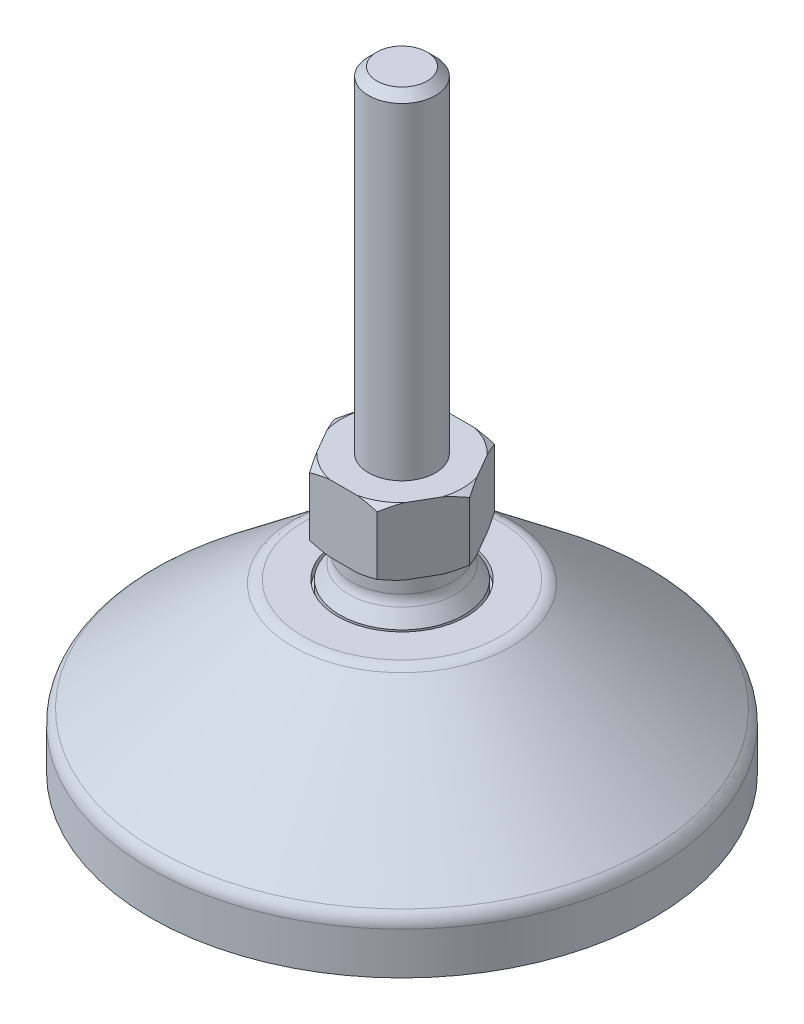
ISO-10303-21;
HEADER;
FILE_DESCRIPTION(('STEP AP214'),'2;1');
FILE_NAME('part.step','',(''),(''),'','','');
FILE_SCHEMA(('AUTOMOTIVE_DESIGN { 1 0 10303 214 1 1 1 1 }'));
ENDSEC;
DATA;
#1=APPLICATION_CONTEXT('core data for automotive mechanical design processes');
#2=APPLICATION_PROTOCOL_DEFINITION('international standard','automotive_design',2000,#1);
#3=PRODUCT_CONTEXT('',#1,'mechanical');
#4=PRODUCT('Part','Part','',(#3));
#5=PRODUCT_RELATED_PRODUCT_CATEGORY('part','',(#4));
#6=PRODUCT_DEFINITION_FORMATION('','',#4);
#7=PRODUCT_DEFINITION_CONTEXT('part definition',#1,'design');
#8=PRODUCT_DEFINITION('design','',#6,#7);
#9=PRODUCT_DEFINITION_SHAPE('','',#8);
#10=(LENGTH_UNIT() NAMED_UNIT(*) SI_UNIT(.MILLI.,.METRE.));
#11=(NAMED_UNIT(*) PLANE_ANGLE_UNIT() SI_UNIT($,.RADIAN.));
#12=(NAMED_UNIT(*) SI_UNIT($,.STERADIAN.) SOLID_ANGLE_UNIT());
#13=UNCERTAINTY_MEASURE_WITH_UNIT(LENGTH_MEASURE(1.E-05),#10,'distance_accuracy_value','');
#14=(GEOMETRIC_REPRESENTATION_CONTEXT(3) GLOBAL_UNCERTAINTY_ASSIGNED_CONTEXT((#13)) GLOBAL_UNIT_ASSIGNED_CONTEXT((#10,
#11,#12)) REPRESENTATION_CONTEXT('',''));
#15=CARTESIAN_POINT('',(0.,0.,0.));
#16=DIRECTION('',(0.,0.,1.));
#17=DIRECTION('',(1.,0.,0.));
#18=AXIS2_PLACEMENT_3D('',#15,#16,#17);
#19=CARTESIAN_POINT('',(0.,0.,0.));
#20=DIRECTION('',(0.,1.,0.));
#21=DIRECTION('',(0.,0.,1.));
#22=AXIS2_PLACEMENT_3D('',#19,#20,#21);
#23=PLANE('',#22);
#24=CARTESIAN_POINT('',(0.,0.,0.));
#25=DIRECTION('',(0.,-1.,0.));
#26=DIRECTION('',(0.,0.,-1.));
#27=AXIS2_PLACEMENT_3D('',#24,#25,#26);
#28=CIRCLE('',#27,21.5);
#29=CARTESIAN_POINT('',(-4.19512195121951,0.,21.0867482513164));
#30=VERTEX_POINT('',#29);
#31=CARTESIAN_POINT('',(-20.2077439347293,0.,7.34146341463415));
#32=VERTEX_POINT('',#31);
#33=EDGE_CURVE('E658',#30,#32,#28,.T.);
#34=ORIENTED_EDGE('',*,*,#33,.F.);
#35=CARTESIAN_POINT('',(-4.,0.,20.1059692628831));
#36=DIRECTION('',(0.,1.,0.));
#37=DIRECTION('',(0.,0.,1.));
#38=AXIS2_PLACEMENT_3D('',#35,#36,#37);
#39=CIRCLE('',#38,1.);
#40=CARTESIAN_POINT('',(-3.,0.,20.1059692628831));
#41=VERTEX_POINT('',#40);
#42=EDGE_CURVE('E838',#30,#41,#39,.T.);
#43=ORIENTED_EDGE('',*,*,#42,.T.);
#44=DIRECTION('',(0.,0.,1.));
#45=VECTOR('',#44,1.);
#46=CARTESIAN_POINT('',(-3.,0.,6.));
#47=LINE('',#46,#45);
#48=CARTESIAN_POINT('',(-3.,0.,7.));
#49=VERTEX_POINT('',#48);
#50=EDGE_CURVE('E649',#49,#41,#47,.T.);
#51=ORIENTED_EDGE('',*,*,#50,.F.);
#52=CARTESIAN_POINT('',(-4.,0.,7.));
#53=DIRECTION('',(0.,1.,0.));
#54=DIRECTION('',(0.,0.,1.));
#55=AXIS2_PLACEMENT_3D('',#52,#53,#54);
#56=CIRCLE('',#55,1.);
#57=CARTESIAN_POINT('',(-4.,0.,6.));
#58=VERTEX_POINT('',#57);
#59=EDGE_CURVE('E841',#49,#58,#56,.T.);
#60=ORIENTED_EDGE('',*,*,#59,.T.);
#61=DIRECTION('',(1.,0.,0.));
#62=VECTOR('',#61,1.);
#63=CARTESIAN_POINT('',(-20.6458228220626,0.,6.));
#64=LINE('',#63,#62);
#65=CARTESIAN_POINT('',(-19.2678488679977,0.,6.));
#66=VERTEX_POINT('',#65);
#67=EDGE_CURVE('E654',#66,#58,#64,.T.);
#68=ORIENTED_EDGE('',*,*,#67,.F.);
#69=CARTESIAN_POINT('',(-19.2678488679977,0.,7.));
#70=DIRECTION('',(0.,1.,0.));
#71=DIRECTION('',(0.,0.,1.));
#72=AXIS2_PLACEMENT_3D('',#69,#70,#71);
#73=CIRCLE('',#72,1.);
#74=EDGE_CURVE('E844',#66,#32,#73,.T.);
#75=ORIENTED_EDGE('',*,*,#74,.T.);
#76=EDGE_LOOP('',(#34,#43,#51,#60,#68,#75));
#77=FACE_BOUND('',#76,.T.);
#78=CARTESIAN_POINT('',(0.,0.,0.));
#79=DIRECTION('',(0.,1.,0.));
#80=DIRECTION('',(0.,0.,1.));
#81=AXIS2_PLACEMENT_3D('',#78,#79,#80);
#82=CIRCLE('',#81,25.75);
#83=CARTESIAN_POINT('',(0.,0.,25.75));
#84=VERTEX_POINT('',#83);
#85=EDGE_CURVE('E389',#84,#84,#82,.T.);
#86=ORIENTED_EDGE('',*,*,#85,.F.);
#87=EDGE_LOOP('',(#86));
#88=FACE_BOUND('',#87,.T.);
#89=DIRECTION('',(0.,0.,-1.));
#90=VECTOR('',#89,1.);
#91=CARTESIAN_POINT('',(3.,0.,6.));
#92=LINE('',#91,#90);
#93=CARTESIAN_POINT('',(3.,0.,20.1059692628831));
#94=VERTEX_POINT('',#93);
#95=CARTESIAN_POINT('',(3.,0.,7.));
#96=VERTEX_POINT('',#95);
#97=EDGE_CURVE('E610',#94,#96,#92,.T.);
#98=ORIENTED_EDGE('',*,*,#97,.F.);
#99=CARTESIAN_POINT('',(4.,0.,20.1059692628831));
#100=DIRECTION('',(0.,1.,0.));
#101=DIRECTION('',(0.,0.,1.));
#102=AXIS2_PLACEMENT_3D('',#99,#100,#101);
#103=CIRCLE('',#102,1.);
#104=CARTESIAN_POINT('',(4.19512195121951,0.,21.0867482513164));
#105=VERTEX_POINT('',#104);
#106=EDGE_CURVE('E832',#94,#105,#103,.T.);
#107=ORIENTED_EDGE('',*,*,#106,.T.);
#108=CARTESIAN_POINT('',(0.,0.,0.));
#109=DIRECTION('',(0.,-1.,0.));
#110=DIRECTION('',(0.,0.,-1.));
#111=AXIS2_PLACEMENT_3D('',#108,#109,#110);
#112=CIRCLE('',#111,21.5);
#113=CARTESIAN_POINT('',(20.2077439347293,0.,7.34146341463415));
#114=VERTEX_POINT('',#113);
#115=EDGE_CURVE('E601',#114,#105,#112,.T.);
#116=ORIENTED_EDGE('',*,*,#115,.F.);
#117=CARTESIAN_POINT('',(19.2678488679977,0.,7.));
#118=DIRECTION('',(0.,1.,0.));
#119=DIRECTION('',(0.,0.,1.));
#120=AXIS2_PLACEMENT_3D('',#117,#118,#119);
#121=CIRCLE('',#120,1.);
#122=CARTESIAN_POINT('',(19.2678488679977,0.,6.));
#123=VERTEX_POINT('',#122);
#124=EDGE_CURVE('E829',#114,#123,#121,.T.);
#125=ORIENTED_EDGE('',*,*,#124,.T.);
#126=DIRECTION('',(1.,0.,0.));
#127=VECTOR('',#126,1.);
#128=CARTESIAN_POINT('',(3.,0.,6.));
#129=LINE('',#128,#127);
#130=CARTESIAN_POINT('',(4.,0.,6.));
#131=VERTEX_POINT('',#130);
#132=EDGE_CURVE('E606',#131,#123,#129,.T.);
#133=ORIENTED_EDGE('',*,*,#132,.F.);
#134=CARTESIAN_POINT('',(4.,0.,7.));
#135=DIRECTION('',(0.,1.,0.));
#136=DIRECTION('',(0.,0.,1.));
#137=AXIS2_PLACEMENT_3D('',#134,#135,#136);
#138=CIRCLE('',#137,1.);
#139=EDGE_CURVE('E835',#131,#96,#138,.T.);
#140=ORIENTED_EDGE('',*,*,#139,.T.);
#141=EDGE_LOOP('',(#98,#107,#116,#125,#133,#140));
#142=FACE_BOUND('',#141,.T.);
#143=CARTESIAN_POINT('',(0.,0.,0.));
#144=DIRECTION('',(0.,-1.,0.));
#145=DIRECTION('',(0.,0.,-1.));
#146=AXIS2_PLACEMENT_3D('',#143,#144,#145);
#147=CIRCLE('',#146,21.5);
#148=CARTESIAN_POINT('',(-20.2077439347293,0.,-7.34146341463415));
#149=VERTEX_POINT('',#148);
#150=CARTESIAN_POINT('',(-4.19512195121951,0.,-21.0867482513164));
#151=VERTEX_POINT('',#150);
#152=EDGE_CURVE('E634',#149,#151,#147,.T.);
#153=ORIENTED_EDGE('',*,*,#152,.F.);
#154=CARTESIAN_POINT('',(-19.2678488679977,0.,-7.));
#155=DIRECTION('',(0.,1.,0.));
#156=DIRECTION('',(0.,0.,1.));
#157=AXIS2_PLACEMENT_3D('',#154,#155,#156);
#158=CIRCLE('',#157,1.);
#159=CARTESIAN_POINT('',(-19.2678488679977,0.,-6.));
#160=VERTEX_POINT('',#159);
#161=EDGE_CURVE('E847',#149,#160,#158,.T.);
#162=ORIENTED_EDGE('',*,*,#161,.T.);
#163=DIRECTION('',(-1.,0.,0.));
#164=VECTOR('',#163,1.);
#165=CARTESIAN_POINT('',(-20.6458228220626,0.,-6.));
#166=LINE('',#165,#164);
#167=CARTESIAN_POINT('',(-4.,0.,-6.));
#168=VERTEX_POINT('',#167);
#169=EDGE_CURVE('E626',#168,#160,#166,.T.);
#170=ORIENTED_EDGE('',*,*,#169,.F.);
#171=CARTESIAN_POINT('',(-4.,0.,-7.));
#172=DIRECTION('',(0.,1.,0.));
#173=DIRECTION('',(0.,0.,1.));
#174=AXIS2_PLACEMENT_3D('',#171,#172,#173);
#175=CIRCLE('',#174,1.);
#176=CARTESIAN_POINT('',(-3.,0.,-7.));
#177=VERTEX_POINT('',#176);
#178=EDGE_CURVE('E12',#168,#177,#175,.T.);
#179=ORIENTED_EDGE('',*,*,#178,.T.);
#180=DIRECTION('',(0.,0.,1.));
#181=VECTOR('',#180,1.);
#182=CARTESIAN_POINT('',(-3.,0.,-21.2896688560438));
#183=LINE('',#182,#181);
#184=CARTESIAN_POINT('',(-3.,0.,-20.1059692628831));
#185=VERTEX_POINT('',#184);
#186=EDGE_CURVE('E631',#185,#177,#183,.T.);
#187=ORIENTED_EDGE('',*,*,#186,.F.);
#188=CARTESIAN_POINT('',(-4.,0.,-20.1059692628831));
#189=DIRECTION('',(0.,1.,0.));
#190=DIRECTION('',(0.,0.,1.));
#191=AXIS2_PLACEMENT_3D('',#188,#189,#190);
#192=CIRCLE('',#191,1.);
#193=EDGE_CURVE('E66',#185,#151,#192,.T.);
#194=ORIENTED_EDGE('',*,*,#193,.T.);
#195=EDGE_LOOP('',(#153,#162,#170,#179,#187,#194));
#196=FACE_BOUND('',#195,.T.);
#197=CARTESIAN_POINT('',(0.,0.,0.));
#198=DIRECTION('',(0.,-1.,0.));
#199=DIRECTION('',(0.,0.,-1.));
#200=AXIS2_PLACEMENT_3D('',#197,#198,#199);
#201=CIRCLE('',#200,21.5);
#202=CARTESIAN_POINT('',(4.19512195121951,0.,-21.0867482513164));
#203=VERTEX_POINT('',#202);
#204=CARTESIAN_POINT('',(20.2077439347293,0.,-7.34146341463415));
#205=VERTEX_POINT('',#204);
#206=EDGE_CURVE('E682',#203,#205,#201,.T.);
#207=ORIENTED_EDGE('',*,*,#206,.F.);
#208=CARTESIAN_POINT('',(4.,0.,-20.1059692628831));
#209=DIRECTION('',(0.,1.,0.));
#210=DIRECTION('',(0.,0.,1.));
#211=AXIS2_PLACEMENT_3D('',#208,#209,#210);
#212=CIRCLE('',#211,1.);
#213=CARTESIAN_POINT('',(3.,0.,-20.1059692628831));
#214=VERTEX_POINT('',#213);
#215=EDGE_CURVE('E820',#203,#214,#212,.T.);
#216=ORIENTED_EDGE('',*,*,#215,.T.);
#217=DIRECTION('',(0.,0.,-1.));
#218=VECTOR('',#217,1.);
#219=CARTESIAN_POINT('',(3.,0.,-21.2896688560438));
#220=LINE('',#219,#218);
#221=CARTESIAN_POINT('',(3.,0.,-7.));
#222=VERTEX_POINT('',#221);
#223=EDGE_CURVE('E673',#222,#214,#220,.T.);
#224=ORIENTED_EDGE('',*,*,#223,.F.);
#225=CARTESIAN_POINT('',(4.,0.,-7.));
#226=DIRECTION('',(0.,1.,0.));
#227=DIRECTION('',(0.,0.,1.));
#228=AXIS2_PLACEMENT_3D('',#225,#226,#227);
#229=CIRCLE('',#228,1.);
#230=CARTESIAN_POINT('',(4.,0.,-6.));
#231=VERTEX_POINT('',#230);
#232=EDGE_CURVE('E823',#222,#231,#229,.T.);
#233=ORIENTED_EDGE('',*,*,#232,.T.);
#234=DIRECTION('',(-1.,0.,0.));
#235=VECTOR('',#234,1.);
#236=CARTESIAN_POINT('',(3.,0.,-6.));
#237=LINE('',#236,#235);
#238=CARTESIAN_POINT('',(19.2678488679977,0.,-6.));
#239=VERTEX_POINT('',#238);
#240=EDGE_CURVE('E678',#239,#231,#237,.T.);
#241=ORIENTED_EDGE('',*,*,#240,.F.);
#242=CARTESIAN_POINT('',(19.2678488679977,0.,-7.));
#243=DIRECTION('',(0.,1.,0.));
#244=DIRECTION('',(0.,0.,1.));
#245=AXIS2_PLACEMENT_3D('',#242,#243,#244);
#246=CIRCLE('',#245,1.);
#247=EDGE_CURVE('E826',#239,#205,#246,.T.);
#248=ORIENTED_EDGE('',*,*,#247,.T.);
#249=EDGE_LOOP('',(#207,#216,#224,#233,#241,#248));
#250=FACE_BOUND('',#249,.T.);
#251=ADVANCED_FACE('F57',(#77,#88,#142,#196,#250),#23,.F.);
#252=CARTESIAN_POINT('',(0.,27.,0.));
#253=DIRECTION('',(0.,1.,0.));
#254=DIRECTION('',(0.,0.,1.));
#255=AXIS2_PLACEMENT_3D('',#252,#253,#254);
#256=PLANE('',#255);
#257=CARTESIAN_POINT('',(0.,27.,0.));
#258=DIRECTION('',(0.,1.,0.));
#259=DIRECTION('',(0.,0.,1.));
#260=AXIS2_PLACEMENT_3D('',#257,#258,#259);
#261=CIRCLE('',#260,6.);
#262=CARTESIAN_POINT('',(0.,27.,6.));
#263=VERTEX_POINT('',#262);
#264=EDGE_CURVE('E357',#263,#263,#261,.T.);
#265=ORIENTED_EDGE('',*,*,#264,.T.);
#266=EDGE_LOOP('',(#265));
#267=FACE_BOUND('',#266,.T.);
#268=DIRECTION('',(1.,0.,0.));
#269=VECTOR('',#268,1.);
#270=CARTESIAN_POINT('',(-4.04145188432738,27.,7.));
#271=LINE('',#270,#269);
#272=CARTESIAN_POINT('',(-1.68522995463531,27.,7.));
#273=VERTEX_POINT('',#272);
#274=CARTESIAN_POINT('',(1.68522995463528,27.,7.));
#275=VERTEX_POINT('',#274);
#276=EDGE_CURVE('E514',#273,#275,#271,.T.);
#277=ORIENTED_EDGE('',*,*,#276,.F.);
#278=CARTESIAN_POINT('',(0.,27.,0.));
#279=DIRECTION('',(0.,1.,0.));
#280=DIRECTION('',(0.,0.,1.));
#281=AXIS2_PLACEMENT_3D('',#278,#279,#280);
#282=CIRCLE('',#281,7.2);
#283=CARTESIAN_POINT('',(-5.21956284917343,27.,4.95945195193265));
#284=VERTEX_POINT('',#283);
#285=EDGE_CURVE('E591',#284,#273,#282,.T.);
#286=ORIENTED_EDGE('',*,*,#285,.F.);
#287=DIRECTION('',(0.5,0.,0.866025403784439));
#288=VECTOR('',#287,1.);
#289=CARTESIAN_POINT('',(-8.08290376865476,27.,0.));
#290=LINE('',#289,#288);
#291=CARTESIAN_POINT('',(-6.90479280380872,27.,2.04054804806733));
#292=VERTEX_POINT('',#291);
#293=EDGE_CURVE('E548',#292,#284,#290,.T.);
#294=ORIENTED_EDGE('',*,*,#293,.F.);
#295=CARTESIAN_POINT('',(-6.90479280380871,27.,-2.04054804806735));
#296=VERTEX_POINT('',#295);
#297=EDGE_CURVE('E588',#296,#292,#282,.T.);
#298=ORIENTED_EDGE('',*,*,#297,.F.);
#299=DIRECTION('',(-0.5,0.,0.866025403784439));
#300=VECTOR('',#299,1.);
#301=CARTESIAN_POINT('',(-4.04145188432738,27.,-7.));
#302=LINE('',#301,#300);
#303=CARTESIAN_POINT('',(-5.21956284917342,27.,-4.95945195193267));
#304=VERTEX_POINT('',#303);
#305=EDGE_CURVE('E544',#304,#296,#302,.T.);
#306=ORIENTED_EDGE('',*,*,#305,.F.);
#307=CARTESIAN_POINT('',(-1.68522995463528,27.,-7.));
#308=VERTEX_POINT('',#307);
#309=EDGE_CURVE('E580',#308,#304,#282,.T.);
#310=ORIENTED_EDGE('',*,*,#309,.F.);
#311=DIRECTION('',(-1.,0.,0.));
#312=VECTOR('',#311,1.);
#313=CARTESIAN_POINT('',(4.04145188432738,27.,-7.));
#314=LINE('',#313,#312);
#315=CARTESIAN_POINT('',(1.6852299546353,27.,-7.));
#316=VERTEX_POINT('',#315);
#317=EDGE_CURVE('E540',#316,#308,#314,.T.);
#318=ORIENTED_EDGE('',*,*,#317,.F.);
#319=CARTESIAN_POINT('',(5.21956284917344,27.,-4.95945195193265));
#320=VERTEX_POINT('',#319);
#321=EDGE_CURVE('E587',#320,#316,#282,.T.);
#322=ORIENTED_EDGE('',*,*,#321,.F.);
#323=DIRECTION('',(-0.5,0.,-0.866025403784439));
#324=VECTOR('',#323,1.);
#325=CARTESIAN_POINT('',(8.08290376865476,27.,0.));
#326=LINE('',#325,#324);
#327=CARTESIAN_POINT('',(6.90479280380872,27.,-2.04054804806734));
#328=VERTEX_POINT('',#327);
#329=EDGE_CURVE('E537',#328,#320,#326,.T.);
#330=ORIENTED_EDGE('',*,*,#329,.F.);
#331=CARTESIAN_POINT('',(6.90479280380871,27.,2.04054804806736));
#332=VERTEX_POINT('',#331);
#333=EDGE_CURVE('E330',#332,#328,#282,.T.);
#334=ORIENTED_EDGE('',*,*,#333,.F.);
#335=DIRECTION('',(0.5,0.,-0.866025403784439));
#336=VECTOR('',#335,1.);
#337=CARTESIAN_POINT('',(4.04145188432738,27.,7.));
#338=LINE('',#337,#336);
#339=CARTESIAN_POINT('',(5.21956284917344,27.,4.95945195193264));
#340=VERTEX_POINT('',#339);
#341=EDGE_CURVE('E346',#340,#332,#338,.T.);
#342=ORIENTED_EDGE('',*,*,#341,.F.);
#343=EDGE_CURVE('E592',#275,#340,#282,.T.);
#344=ORIENTED_EDGE('',*,*,#343,.F.);
#345=EDGE_LOOP('',(#277,#286,#294,#298,#306,#310,#318,#322,#330,#334,#342,#344));
#346=FACE_BOUND('',#345,.T.);
#347=ADVANCED_FACE('F583',(#267,#346),#256,.F.);
#348=CARTESIAN_POINT('',(0.,35.,0.));
#349=DIRECTION('',(0.,1.,0.));
#350=DIRECTION('',(0.,0.,1.));
#351=AXIS2_PLACEMENT_3D('',#348,#349,#350);
#352=PLANE('',#351);
#353=CARTESIAN_POINT('',(0.,35.,0.));
#354=DIRECTION('',(0.,1.,0.));
#355=DIRECTION('',(0.,0.,1.));
#356=AXIS2_PLACEMENT_3D('',#353,#354,#355);
#357=CIRCLE('',#356,4.);
#358=CARTESIAN_POINT('',(0.,35.,4.));
#359=VERTEX_POINT('',#358);
#360=EDGE_CURVE('E504',#359,#359,#357,.T.);
#361=ORIENTED_EDGE('',*,*,#360,.F.);
#362=EDGE_LOOP('',(#361));
#363=FACE_BOUND('',#362,.T.);
#364=CARTESIAN_POINT('',(0.,35.,0.));
#365=DIRECTION('',(0.,1.,0.));
#366=DIRECTION('',(0.,0.,1.));
#367=AXIS2_PLACEMENT_3D('',#364,#365,#366);
#368=CIRCLE('',#367,7.2);
#369=CARTESIAN_POINT('',(-5.21956284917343,35.,4.95945195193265));
#370=VERTEX_POINT('',#369);
#371=CARTESIAN_POINT('',(-1.68522995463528,35.,7.));
#372=VERTEX_POINT('',#371);
#373=EDGE_CURVE('E595',#370,#372,#368,.T.);
#374=ORIENTED_EDGE('',*,*,#373,.T.);
#375=DIRECTION('',(1.,0.,0.));
#376=VECTOR('',#375,1.);
#377=CARTESIAN_POINT('',(-4.04145188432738,35.,7.));
#378=LINE('',#377,#376);
#379=CARTESIAN_POINT('',(1.68522995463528,35.,7.));
#380=VERTEX_POINT('',#379);
#381=EDGE_CURVE('E530',#372,#380,#378,.T.);
#382=ORIENTED_EDGE('',*,*,#381,.T.);
#383=CARTESIAN_POINT('',(5.21956284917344,35.,4.95945195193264));
#384=VERTEX_POINT('',#383);
#385=EDGE_CURVE('E596',#380,#384,#368,.T.);
#386=ORIENTED_EDGE('',*,*,#385,.T.);
#387=DIRECTION('',(0.5,0.,-0.866025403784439));
#388=VECTOR('',#387,1.);
#389=CARTESIAN_POINT('',(4.04145188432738,35.,7.));
#390=LINE('',#389,#388);
#391=CARTESIAN_POINT('',(6.90479280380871,35.,2.04054804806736));
#392=VERTEX_POINT('',#391);
#393=EDGE_CURVE('E509',#384,#392,#390,.T.);
#394=ORIENTED_EDGE('',*,*,#393,.T.);
#395=CARTESIAN_POINT('',(6.90479280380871,35.,-2.04054804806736));
#396=VERTEX_POINT('',#395);
#397=EDGE_CURVE('E600',#392,#396,#368,.T.);
#398=ORIENTED_EDGE('',*,*,#397,.T.);
#399=DIRECTION('',(-0.5,0.,-0.866025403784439));
#400=VECTOR('',#399,1.);
#401=CARTESIAN_POINT('',(8.08290376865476,35.,0.));
#402=LINE('',#401,#400);
#403=CARTESIAN_POINT('',(5.21956284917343,35.,-4.95945195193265));
#404=VERTEX_POINT('',#403);
#405=EDGE_CURVE('E513',#396,#404,#402,.T.);
#406=ORIENTED_EDGE('',*,*,#405,.T.);
#407=CARTESIAN_POINT('',(1.68522995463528,35.,-7.));
#408=VERTEX_POINT('',#407);
#409=EDGE_CURVE('E1749',#404,#408,#368,.T.);
#410=ORIENTED_EDGE('',*,*,#409,.T.);
#411=DIRECTION('',(-1.,0.,0.));
#412=VECTOR('',#411,1.);
#413=CARTESIAN_POINT('',(4.04145188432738,35.,-7.));
#414=LINE('',#413,#412);
#415=CARTESIAN_POINT('',(-1.68522995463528,35.,-7.));
#416=VERTEX_POINT('',#415);
#417=EDGE_CURVE('E518',#408,#416,#414,.T.);
#418=ORIENTED_EDGE('',*,*,#417,.T.);
#419=CARTESIAN_POINT('',(-5.21956284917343,35.,-4.95945195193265));
#420=VERTEX_POINT('',#419);
#421=EDGE_CURVE('E1746',#416,#420,#368,.T.);
#422=ORIENTED_EDGE('',*,*,#421,.T.);
#423=DIRECTION('',(-0.5,0.,0.866025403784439));
#424=VECTOR('',#423,1.);
#425=CARTESIAN_POINT('',(-4.04145188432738,35.,-7.));
#426=LINE('',#425,#424);
#427=CARTESIAN_POINT('',(-6.90479280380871,35.,-2.04054804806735));
#428=VERTEX_POINT('',#427);
#429=EDGE_CURVE('E522',#420,#428,#426,.T.);
#430=ORIENTED_EDGE('',*,*,#429,.T.);
#431=CARTESIAN_POINT('',(-6.90479280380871,35.,2.04054804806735));
#432=VERTEX_POINT('',#431);
#433=EDGE_CURVE('E1744',#428,#432,#368,.T.);
#434=ORIENTED_EDGE('',*,*,#433,.T.);
#435=DIRECTION('',(0.5,0.,0.866025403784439));
#436=VECTOR('',#435,1.);
#437=CARTESIAN_POINT('',(-8.08290376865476,35.,0.));
#438=LINE('',#437,#436);
#439=EDGE_CURVE('E526',#432,#370,#438,.T.);
#440=ORIENTED_EDGE('',*,*,#439,.T.);
#441=EDGE_LOOP('',(#374,#382,#386,#394,#398,#406,#410,#418,#422,#430,#434,#440));
#442=FACE_BOUND('',#441,.T.);
#443=ADVANCED_FACE('F428',(#363,#442),#352,.T.);
#444=CARTESIAN_POINT('',(0.,22.,0.));
#445=DIRECTION('',(0.,1.,0.));
#446=DIRECTION('',(0.,0.,1.));
#447=AXIS2_PLACEMENT_3D('',#444,#445,#446);
#448=PLANE('',#447);
#449=CARTESIAN_POINT('',(0.,22.,0.));
#450=DIRECTION('',(0.,1.,0.));
#451=DIRECTION('',(0.,0.,1.));
#452=AXIS2_PLACEMENT_3D('',#449,#450,#451);
#453=CIRCLE('',#452,11.7984378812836);
#454=CARTESIAN_POINT('',(0.,22.,11.7984378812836));
#455=VERTEX_POINT('',#454);
#456=EDGE_CURVE('E1633',#455,#455,#453,.T.);
#457=ORIENTED_EDGE('',*,*,#456,.T.);
#458=EDGE_LOOP('',(#457));
#459=FACE_BOUND('',#458,.T.);
#460=CARTESIAN_POINT('',(0.,22.,0.));
#461=DIRECTION('',(0.,1.,0.));
#462=DIRECTION('',(0.,0.,1.));
#463=AXIS2_PLACEMENT_3D('',#460,#461,#462);
#464=CIRCLE('',#463,7.7);
#465=CARTESIAN_POINT('',(0.,22.,7.7));
#466=VERTEX_POINT('',#465);
#467=EDGE_CURVE('E374',#466,#466,#464,.T.);
#468=ORIENTED_EDGE('',*,*,#467,.F.);
#469=EDGE_LOOP('',(#468));
#470=FACE_BOUND('',#469,.T.);
#471=ADVANCED_FACE('F900',(#459,#470),#448,.T.);
#472=CARTESIAN_POINT('',(0.,2.,0.));
#473=DIRECTION('',(0.,-1.,0.));
#474=DIRECTION('',(0.,0.,-1.));
#475=AXIS2_PLACEMENT_3D('',#472,#473,#474);
#476=CYLINDRICAL_SURFACE('',#475,25.75);
#477=CARTESIAN_POINT('',(0.,2.,0.));
#478=DIRECTION('',(0.,1.,0.));
#479=DIRECTION('',(0.,0.,1.));
#480=AXIS2_PLACEMENT_3D('',#477,#478,#479);
#481=CIRCLE('',#480,25.75);
#482=CARTESIAN_POINT('',(0.,2.,25.75));
#483=VERTEX_POINT('',#482);
#484=EDGE_CURVE('E390',#483,#483,#481,.T.);
#485=ORIENTED_EDGE('',*,*,#484,.F.);
#486=EDGE_LOOP('',(#485));
#487=FACE_BOUND('',#486,.T.);
#488=ORIENTED_EDGE('',*,*,#85,.T.);
#489=EDGE_LOOP('',(#488));
#490=FACE_BOUND('',#489,.T.);
#491=ADVANCED_FACE('F897',(#487,#490),#476,.T.);
#492=CARTESIAN_POINT('',(0.,8.,0.));
#493=DIRECTION('',(0.,-1.,0.));
#494=DIRECTION('',(0.,0.,-1.));
#495=AXIS2_PLACEMENT_3D('',#492,#493,#494);
#496=CYLINDRICAL_SURFACE('',#495,30.);
#497=CARTESIAN_POINT('',(0.,7.03875030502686,0.));
#498=DIRECTION('',(0.,-1.,0.));
#499=DIRECTION('',(0.,0.,-1.));
#500=AXIS2_PLACEMENT_3D('',#497,#498,#499);
#501=CIRCLE('',#500,30.);
#502=CARTESIAN_POINT('',(0.,7.03875030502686,-30.));
#503=VERTEX_POINT('',#502);
#504=EDGE_CURVE('E1629',#503,#503,#501,.T.);
#505=ORIENTED_EDGE('',*,*,#504,.T.);
#506=EDGE_LOOP('',(#505));
#507=FACE_BOUND('',#506,.T.);
#508=CARTESIAN_POINT('',(0.,2.,0.));
#509=DIRECTION('',(0.,1.,0.));
#510=DIRECTION('',(0.,0.,1.));
#511=AXIS2_PLACEMENT_3D('',#508,#509,#510);
#512=CIRCLE('',#511,30.);
#513=CARTESIAN_POINT('',(0.,2.,30.));
#514=VERTEX_POINT('',#513);
#515=EDGE_CURVE('E382',#514,#514,#512,.T.);
#516=ORIENTED_EDGE('',*,*,#515,.T.);
#517=EDGE_LOOP('',(#516));
#518=FACE_BOUND('',#517,.T.);
#519=ADVANCED_FACE('F895',(#507,#518),#496,.T.);
#520=CARTESIAN_POINT('',(0.,2.,0.));
#521=DIRECTION('',(0.,1.,0.));
#522=DIRECTION('',(0.,0.,1.));
#523=AXIS2_PLACEMENT_3D('',#520,#521,#522);
#524=PLANE('',#523);
#525=ORIENTED_EDGE('',*,*,#484,.T.);
#526=EDGE_LOOP('',(#525));
#527=FACE_BOUND('',#526,.T.);
#528=ORIENTED_EDGE('',*,*,#515,.F.);
#529=EDGE_LOOP('',(#528));
#530=FACE_BOUND('',#529,.T.);
#531=ADVANCED_FACE('F1530',(#527,#530),#524,.F.);
#532=CARTESIAN_POINT('',(0.,22.,0.));
#533=DIRECTION('',(0.,-1.,0.));
#534=DIRECTION('',(0.,0.,-1.));
#535=AXIS2_PLACEMENT_3D('',#532,#533,#534);
#536=CONICAL_SURFACE('',#535,12.5,0.896055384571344);
#537=CARTESIAN_POINT('',(0.,8.60048792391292,0.));
#538=DIRECTION('',(0.,-1.,0.));
#539=DIRECTION('',(0.,0.,-1.));
#540=AXIS2_PLACEMENT_3D('',#537,#538,#539);
#541=CIRCLE('',#540,29.2493900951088);
#542=CARTESIAN_POINT('',(0.,8.60048792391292,-29.2493900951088));
#543=VERTEX_POINT('',#542);
#544=EDGE_CURVE('E1634',#543,#543,#541,.F.);
#545=ORIENTED_EDGE('',*,*,#544,.T.);
#546=EDGE_LOOP('',(#545));
#547=FACE_BOUND('',#546,.T.);
#548=CARTESIAN_POINT('',(0.,21.5617376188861,0.));
#549=DIRECTION('',(0.,1.,0.));
#550=DIRECTION('',(0.,0.,1.));
#551=AXIS2_PLACEMENT_3D('',#548,#549,#550);
#552=CIRCLE('',#551,13.0478279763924);
#553=CARTESIAN_POINT('',(0.,21.5617376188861,13.0478279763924));
#554=VERTEX_POINT('',#553);
#555=EDGE_CURVE('E1642',#554,#554,#552,.F.);
#556=ORIENTED_EDGE('',*,*,#555,.T.);
#557=EDGE_LOOP('',(#556));
#558=FACE_BOUND('',#557,.T.);
#559=ADVANCED_FACE('F1504',(#547,#558),#536,.T.);
#560=CARTESIAN_POINT('',(0.,21.,0.));
#561=DIRECTION('',(0.,1.,0.));
#562=DIRECTION('',(0.,0.,1.));
#563=AXIS2_PLACEMENT_3D('',#560,#561,#562);
#564=CYLINDRICAL_SURFACE('',#563,7.7);
#565=CARTESIAN_POINT('',(0.,21.,0.));
#566=DIRECTION('',(0.,1.,0.));
#567=DIRECTION('',(0.,0.,1.));
#568=AXIS2_PLACEMENT_3D('',#565,#566,#567);
#569=CIRCLE('',#568,7.7);
#570=CARTESIAN_POINT('',(0.,21.,7.7));
#571=VERTEX_POINT('',#570);
#572=EDGE_CURVE('E378',#571,#571,#569,.T.);
#573=ORIENTED_EDGE('',*,*,#572,.F.);
#574=EDGE_LOOP('',(#573));
#575=FACE_BOUND('',#574,.T.);
#576=ORIENTED_EDGE('',*,*,#467,.T.);
#577=EDGE_LOOP('',(#576));
#578=FACE_BOUND('',#577,.T.);
#579=ADVANCED_FACE('F1495',(#575,#578),#564,.F.);
#580=CARTESIAN_POINT('',(0.,21.,0.));
#581=DIRECTION('',(0.,1.,0.));
#582=DIRECTION('',(0.,0.,1.));
#583=AXIS2_PLACEMENT_3D('',#580,#581,#582);
#584=PLANE('',#583);
#585=CARTESIAN_POINT('',(0.,21.,0.));
#586=DIRECTION('',(0.,1.,0.));
#587=DIRECTION('',(0.,0.,1.));
#588=AXIS2_PLACEMENT_3D('',#585,#586,#587);
#589=CIRCLE('',#588,7.4);
#590=CARTESIAN_POINT('',(0.,21.,7.4));
#591=VERTEX_POINT('',#590);
#592=EDGE_CURVE('E370',#591,#591,#589,.T.);
#593=ORIENTED_EDGE('',*,*,#592,.F.);
#594=EDGE_LOOP('',(#593));
#595=FACE_BOUND('',#594,.T.);
#596=ORIENTED_EDGE('',*,*,#572,.T.);
#597=EDGE_LOOP('',(#596));
#598=FACE_BOUND('',#597,.T.);
#599=ADVANCED_FACE('F1486',(#595,#598),#584,.T.);
#600=CARTESIAN_POINT('',(0.,21.,0.));
#601=DIRECTION('',(0.,1.,0.));
#602=DIRECTION('',(0.,0.,1.));
#603=AXIS2_PLACEMENT_3D('',#600,#601,#602);
#604=CYLINDRICAL_SURFACE('',#603,7.4);
#605=ORIENTED_EDGE('',*,*,#592,.T.);
#606=EDGE_LOOP('',(#605));
#607=FACE_BOUND('',#606,.T.);
#608=CARTESIAN_POINT('',(0.,22.,0.));
#609=DIRECTION('',(0.,1.,0.));
#610=DIRECTION('',(0.,0.,1.));
#611=AXIS2_PLACEMENT_3D('',#608,#609,#610);
#612=CIRCLE('',#611,7.4);
#613=CARTESIAN_POINT('',(0.,22.,7.4));
#614=VERTEX_POINT('',#613);
#615=EDGE_CURVE('E363',#614,#614,#612,.T.);
#616=ORIENTED_EDGE('',*,*,#615,.F.);
#617=EDGE_LOOP('',(#616));
#618=FACE_BOUND('',#617,.T.);
#619=ADVANCED_FACE('F1481',(#607,#618),#604,.T.);
#620=CARTESIAN_POINT('',(0.,24.1,0.));
#621=DIRECTION('',(0.,-1.,0.));
#622=DIRECTION('',(0.,0.,-1.));
#623=AXIS2_PLACEMENT_3D('',#620,#621,#622);
#624=CONICAL_SURFACE('',#623,6.,0.588002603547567);
#625=CARTESIAN_POINT('',(0.,23.5961508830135,0.));
#626=DIRECTION('',(0.,1.,0.));
#627=DIRECTION('',(0.,0.,1.));
#628=AXIS2_PLACEMENT_3D('',#625,#626,#627);
#629=CIRCLE('',#628,6.33589941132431);
#630=CARTESIAN_POINT('',(0.,23.5961508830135,6.33589941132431));
#631=VERTEX_POINT('',#630);
#632=EDGE_CURVE('E1649',#631,#631,#629,.F.);
#633=ORIENTED_EDGE('',*,*,#632,.T.);
#634=EDGE_LOOP('',(#633));
#635=FACE_BOUND('',#634,.T.);
#636=ORIENTED_EDGE('',*,*,#615,.T.);
#637=EDGE_LOOP('',(#636));
#638=FACE_BOUND('',#637,.T.);
#639=ADVANCED_FACE('F1476',(#635,#638),#624,.T.);
#640=CARTESIAN_POINT('',(0.,27.,0.));
#641=DIRECTION('',(0.,-1.,0.));
#642=DIRECTION('',(0.,0.,-1.));
#643=AXIS2_PLACEMENT_3D('',#640,#641,#642);
#644=CYLINDRICAL_SURFACE('',#643,6.);
#645=CARTESIAN_POINT('',(0.,24.705551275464,0.));
#646=DIRECTION('',(0.,1.,0.));
#647=DIRECTION('',(0.,0.,1.));
#648=AXIS2_PLACEMENT_3D('',#645,#646,#647);
#649=CIRCLE('',#648,6.);
#650=CARTESIAN_POINT('',(0.,24.705551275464,6.));
#651=VERTEX_POINT('',#650);
#652=EDGE_CURVE('E1639',#651,#651,#649,.T.);
#653=ORIENTED_EDGE('',*,*,#652,.T.);
#654=EDGE_LOOP('',(#653));
#655=FACE_BOUND('',#654,.T.);
#656=ORIENTED_EDGE('',*,*,#264,.F.);
#657=EDGE_LOOP('',(#656));
#658=FACE_BOUND('',#657,.T.);
#659=ADVANCED_FACE('F1452',(#655,#658),#644,.T.);
#660=CARTESIAN_POINT('',(4.04145188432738,35.,7.));
#661=DIRECTION('',(-0.866025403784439,0.,-0.5));
#662=DIRECTION('',(-0.5,0.,0.866025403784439));
#663=AXIS2_PLACEMENT_3D('',#660,#661,#662);
#664=PLANE('',#663);
#665=DIRECTION('',(0.,-1.,0.));
#666=VECTOR('',#665,1.);
#667=CARTESIAN_POINT('',(8.08290376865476,35.,0.));
#668=LINE('',#667,#666);
#669=CARTESIAN_POINT('',(8.08290376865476,34.5,0.));
#670=VERTEX_POINT('',#669);
#671=CARTESIAN_POINT('',(8.08290376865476,27.5,0.));
#672=VERTEX_POINT('',#671);
#673=EDGE_CURVE('E343',#670,#672,#668,.T.);
#674=ORIENTED_EDGE('',*,*,#673,.F.);
#675=CARTESIAN_POINT('',(10.8883712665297,32.3250503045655,-4.85921224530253));
#676=CARTESIAN_POINT('',(10.7593149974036,32.443354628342,-4.63568023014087));
#677=CARTESIAN_POINT('',(10.6299546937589,32.5603533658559,-4.41162161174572));
#678=CARTESIAN_POINT('',(10.3704955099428,32.7911160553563,-3.96222512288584));
#679=CARTESIAN_POINT('',(10.240396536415,32.9048795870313,-3.73688709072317));
#680=CARTESIAN_POINT('',(9.97893004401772,33.1288881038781,-3.28401384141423));
#681=CARTESIAN_POINT('',(9.84755974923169,33.239120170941,-3.05647381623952));
#682=CARTESIAN_POINT('',(9.58384515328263,33.4548104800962,-2.59970673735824));
#683=CARTESIAN_POINT('',(9.45150088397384,33.5602688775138,-2.37047973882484));
#684=CARTESIAN_POINT('',(9.1826241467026,33.7677110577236,-1.90477156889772));
#685=CARTESIAN_POINT('',(9.04606536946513,33.8695590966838,-1.66824482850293));
#686=CARTESIAN_POINT('',(8.77158710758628,34.065719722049,-1.19283453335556));
#687=CARTESIAN_POINT('',(8.63366755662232,34.160031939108,-0.953950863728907));
#688=CARTESIAN_POINT('',(8.3564443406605,34.3392409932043,-0.47378616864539));
#689=CARTESIAN_POINT('',(8.21714219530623,34.4241471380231,-0.232507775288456));
#690=CARTESIAN_POINT('',(7.93693537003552,34.58248846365,0.252824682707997));
#691=CARTESIAN_POINT('',(7.79603090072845,34.6559251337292,0.496878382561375));
#692=CARTESIAN_POINT('',(7.45675155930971,34.8150176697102,1.08452743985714));
#693=CARTESIAN_POINT('',(7.25757276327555,34.8941169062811,1.42951523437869));
#694=CARTESIAN_POINT('',(6.95687969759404,34.9872500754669,1.95033090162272));
#695=CARTESIAN_POINT('',(6.85633452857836,35.0140409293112,2.12448024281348));
#696=CARTESIAN_POINT('',(6.65472877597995,35.0584104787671,2.47367164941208));
#697=CARTESIAN_POINT('',(6.55366819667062,35.0759892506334,2.64871370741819));
#698=CARTESIAN_POINT('',(6.35234615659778,35.1012589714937,2.99741370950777));
#699=CARTESIAN_POINT('',(6.25208803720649,35.1090559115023,3.17106586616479));
#700=CARTESIAN_POINT('',(6.0515013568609,35.1148708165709,3.51849218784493));
#701=CARTESIAN_POINT('',(5.95117279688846,35.1128889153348,3.69226635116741));
#702=CARTESIAN_POINT('',(5.7506710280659,35.0992071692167,4.03954560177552));
#703=CARTESIAN_POINT('',(5.65049783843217,35.0875062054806,4.21305065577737));
#704=CARTESIAN_POINT('',(5.45053601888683,35.0547474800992,4.55939468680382));
#705=CARTESIAN_POINT('',(5.35074740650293,35.0336892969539,4.73223363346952));
#706=CARTESIAN_POINT('',(5.10920191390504,34.9719332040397,5.15060269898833));
#707=CARTESIAN_POINT('',(4.96773359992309,34.9266880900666,5.39563300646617));
#708=CARTESIAN_POINT('',(4.68626678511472,34.8206045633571,5.88314783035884));
#709=CARTESIAN_POINT('',(4.5462685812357,34.7597630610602,6.12563183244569));
#710=CARTESIAN_POINT('',(4.26772270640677,34.6248944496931,6.60808743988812));
#711=CARTESIAN_POINT('',(4.1291768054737,34.5508528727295,6.84805597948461));
#712=CARTESIAN_POINT('',(3.85366553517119,34.3919581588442,7.3252554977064));
#713=CARTESIAN_POINT('',(3.71670009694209,34.3071054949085,7.56248659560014));
#714=CARTESIAN_POINT('',(3.44278828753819,34.1276590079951,8.03691576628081));
#715=CARTESIAN_POINT('',(3.30585726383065,34.0329721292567,8.27408725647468));
#716=CARTESIAN_POINT('',(3.03331395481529,33.8363210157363,8.74614611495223));
#717=CARTESIAN_POINT('',(2.8977016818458,33.7343567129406,8.9810334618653));
#718=CARTESIAN_POINT('',(2.62770813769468,33.5245884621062,9.44867599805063));
#719=CARTESIAN_POINT('',(2.49332618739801,33.4167879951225,9.68143236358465));
#720=CARTESIAN_POINT('',(2.22555657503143,33.1963855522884,10.1452229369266));
#721=CARTESIAN_POINT('',(2.09216889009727,33.0837836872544,10.3762571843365));
#722=CARTESIAN_POINT('',(1.8984028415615,32.9168140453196,10.7118698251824));
#723=CARTESIAN_POINT('',(1.8376868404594,32.8640053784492,10.8170330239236));
#724=CARTESIAN_POINT('',(1.7164213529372,32.7576306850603,11.0270710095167));
#725=CARTESIAN_POINT('',(1.65587186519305,32.7040646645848,11.1319457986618));
#726=CARTESIAN_POINT('',(1.53535146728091,32.5966164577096,11.340693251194));
#727=CARTESIAN_POINT('',(1.47537947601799,32.5427391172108,11.4445677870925));
#728=CARTESIAN_POINT('',(1.3555777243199,32.4343539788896,11.6520705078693));
#729=CARTESIAN_POINT('',(1.29574796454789,32.3798461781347,11.7556986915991));
#730=CARTESIAN_POINT('',(1.23598438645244,32.3250503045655,11.8592122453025));
#731=B_SPLINE_CURVE_WITH_KNOTS('',3,(#675,#676,#677,#678,#679,#680,#681,#682,#683,#684,#685,
#686,#687,#688,#689,#690,#691,#692,#693,#694,#695,#696,#697,#698,#699,#700,#701,#702,#703,#704,
#705,#706,#707,#708,#709,#710,#711,#712,#713,#714,#715,#716,#717,#718,#719,#720,#721,#722,#723,
#724,#725,#726,#727,#728,#729,#730),.UNSPECIFIED.,.F.,.F.,(4,2,2,2,2,2,2,2,2,2,2,2,2,2,2,2,2,2,
2,2,2,2,2,2,2,2,2,4),(0.,0.851808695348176,1.70372755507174,2.55847131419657,3.41318724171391,
4.28756576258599,5.16198711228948,6.03553529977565,6.90896996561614,8.12598201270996,
8.73440814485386,9.3428292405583,9.9445991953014,10.5463609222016,11.1481919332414,
11.750050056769,12.609105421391,13.4683310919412,14.328504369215,15.1886400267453,
16.0578210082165,16.9270101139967,17.7956863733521,18.6643425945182,19.0615943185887,
19.4588428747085,19.8533077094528,20.2477743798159),.UNSPECIFIED.);
#732=EDGE_CURVE('E508',#670,#392,#731,.T.);
#733=ORIENTED_EDGE('',*,*,#732,.T.);
#734=ORIENTED_EDGE('',*,*,#393,.F.);
#735=CARTESIAN_POINT('',(4.04145188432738,34.5,7.));
#736=VERTEX_POINT('',#735);
#737=EDGE_CURVE('E1714',#384,#736,#731,.T.);
#738=ORIENTED_EDGE('',*,*,#737,.T.);
#739=DIRECTION('',(0.,-1.,0.));
#740=VECTOR('',#739,1.);
#741=CARTESIAN_POINT('',(4.04145188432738,35.,7.));
#742=LINE('',#741,#740);
#743=CARTESIAN_POINT('',(4.04145188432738,27.5,7.));
#744=VERTEX_POINT('',#743);
#745=EDGE_CURVE('E534',#736,#744,#742,.T.);
#746=ORIENTED_EDGE('',*,*,#745,.T.);
#747=CARTESIAN_POINT('',(1.23598438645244,29.6749496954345,11.8592122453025));
#748=CARTESIAN_POINT('',(1.36504065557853,29.556645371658,11.6356802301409));
#749=CARTESIAN_POINT('',(1.49440095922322,29.4396466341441,11.4116216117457));
#750=CARTESIAN_POINT('',(1.75386014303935,29.2088839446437,10.9622251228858));
#751=CARTESIAN_POINT('',(1.88395911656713,29.0951204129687,10.7368870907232));
#752=CARTESIAN_POINT('',(2.14542560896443,28.8711118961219,10.2840138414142));
#753=CARTESIAN_POINT('',(2.27679590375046,28.760879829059,10.0564738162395));
#754=CARTESIAN_POINT('',(2.54051049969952,28.5451895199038,9.59970673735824));
#755=CARTESIAN_POINT('',(2.67285476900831,28.4397311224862,9.37047973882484));
#756=CARTESIAN_POINT('',(2.94173150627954,28.2322889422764,8.90477156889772));
#757=CARTESIAN_POINT('',(3.07829028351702,28.1304409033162,8.66824482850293));
#758=CARTESIAN_POINT('',(3.35276854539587,27.934280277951,8.19283453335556));
#759=CARTESIAN_POINT('',(3.49068809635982,27.839968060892,7.95395086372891));
#760=CARTESIAN_POINT('',(3.76791131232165,27.6607590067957,7.47378616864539));
#761=CARTESIAN_POINT('',(3.90721345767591,27.5758528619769,7.23250777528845));
#762=CARTESIAN_POINT('',(4.18742028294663,27.41751153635,6.747175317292));
#763=CARTESIAN_POINT('',(4.3283247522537,27.3440748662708,6.50312161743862));
#764=CARTESIAN_POINT('',(4.66760409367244,27.1849823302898,5.91547256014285));
#765=CARTESIAN_POINT('',(4.8667828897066,27.1058830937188,5.5704847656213));
#766=CARTESIAN_POINT('',(5.16747595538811,27.0127499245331,5.04966909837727));
#767=CARTESIAN_POINT('',(5.26802112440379,26.9859590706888,4.87551975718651));
#768=CARTESIAN_POINT('',(5.4696268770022,26.9415895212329,4.52632835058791));
#769=CARTESIAN_POINT('',(5.57068745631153,26.9240107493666,4.3512862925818));
#770=CARTESIAN_POINT('',(5.77200949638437,26.8987410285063,4.00258629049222));
#771=CARTESIAN_POINT('',(5.87226761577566,26.8909440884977,3.82893413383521));
#772=CARTESIAN_POINT('',(6.07285429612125,26.8851291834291,3.48150781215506));
#773=CARTESIAN_POINT('',(6.17318285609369,26.8871110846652,3.30773364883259));
#774=CARTESIAN_POINT('',(6.37368462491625,26.9007928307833,2.96045439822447));
#775=CARTESIAN_POINT('',(6.47385781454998,26.9124937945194,2.78694934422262));
#776=CARTESIAN_POINT('',(6.67381963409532,26.9452525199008,2.44060531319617));
#777=CARTESIAN_POINT('',(6.77360824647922,26.9663107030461,2.26776636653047));
#778=CARTESIAN_POINT('',(7.01515373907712,27.0280667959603,1.84939730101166));
#779=CARTESIAN_POINT('',(7.15662205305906,27.0733119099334,1.60436699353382));
#780=CARTESIAN_POINT('',(7.43808886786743,27.1793954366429,1.11685216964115));
#781=CARTESIAN_POINT('',(7.57808707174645,27.2402369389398,0.874368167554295));
#782=CARTESIAN_POINT('',(7.85663294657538,27.3751055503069,0.391912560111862));
#783=CARTESIAN_POINT('',(7.99517884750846,27.4491471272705,0.151944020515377));
#784=CARTESIAN_POINT('',(8.27069011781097,27.6080418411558,-0.325255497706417));
#785=CARTESIAN_POINT('',(8.40765555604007,27.6928945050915,-0.562486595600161));
#786=CARTESIAN_POINT('',(8.68156736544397,27.8723409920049,-1.03691576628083));
#787=CARTESIAN_POINT('',(8.81849838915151,27.9670278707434,-1.27408725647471));
#788=CARTESIAN_POINT('',(9.09104169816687,28.1636789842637,-1.74614611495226));
#789=CARTESIAN_POINT('',(9.22665397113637,28.2656432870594,-1.98103346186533));
#790=CARTESIAN_POINT('',(9.49664751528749,28.4754115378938,-2.44867599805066));
#791=CARTESIAN_POINT('',(9.63102946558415,28.5832120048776,-2.68143236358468));
#792=CARTESIAN_POINT('',(9.89879907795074,28.8036144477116,-3.14522293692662));
#793=CARTESIAN_POINT('',(10.0321867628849,28.9162163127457,-3.37625718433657));
#794=CARTESIAN_POINT('',(10.2259528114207,29.0831859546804,-3.71186982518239));
#795=CARTESIAN_POINT('',(10.2866688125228,29.1359946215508,-3.81703302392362));
#796=CARTESIAN_POINT('',(10.407934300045,29.2423693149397,-4.02707100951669));
#797=CARTESIAN_POINT('',(10.4684837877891,29.2959353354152,-4.13194579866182));
#798=CARTESIAN_POINT('',(10.5890041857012,29.4033835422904,-4.34069325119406));
#799=CARTESIAN_POINT('',(10.6489761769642,29.4572608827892,-4.44456778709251));
#800=CARTESIAN_POINT('',(10.7687779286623,29.5656460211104,-4.65207050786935));
#801=CARTESIAN_POINT('',(10.8286076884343,29.6201538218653,-4.7556986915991));
#802=CARTESIAN_POINT('',(10.8883712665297,29.6749496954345,-4.85921224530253));
#803=B_SPLINE_CURVE_WITH_KNOTS('',3,(#747,#748,#749,#750,#751,#752,#753,#754,#755,#756,#757,
#758,#759,#760,#761,#762,#763,#764,#765,#766,#767,#768,#769,#770,#771,#772,#773,#774,#775,#776,
#777,#778,#779,#780,#781,#782,#783,#784,#785,#786,#787,#788,#789,#790,#791,#792,#793,#794,#795,
#796,#797,#798,#799,#800,#801,#802),.UNSPECIFIED.,.F.,.F.,(4,2,2,2,2,2,2,2,2,2,2,2,2,2,2,2,2,2,
2,2,2,2,2,2,2,2,2,4),(0.,0.85180869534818,1.70372755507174,2.55847131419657,3.41318724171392,
4.28756576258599,5.16198711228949,6.03553529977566,6.90896996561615,8.12598201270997,
8.73440814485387,9.34282924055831,9.94459919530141,10.5463609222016,11.1481919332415,
11.7500500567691,12.609105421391,13.4683310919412,14.328504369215,15.1886400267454,
16.0578210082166,16.9270101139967,17.7956863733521,18.6643425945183,19.0615943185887,
19.4588428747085,19.8533077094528,20.2477743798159),.UNSPECIFIED.);
#804=EDGE_CURVE('E350',#744,#340,#803,.T.);
#805=ORIENTED_EDGE('',*,*,#804,.T.);
#806=ORIENTED_EDGE('',*,*,#341,.T.);
#807=EDGE_CURVE('E328',#332,#672,#803,.T.);
#808=ORIENTED_EDGE('',*,*,#807,.T.);
#809=EDGE_LOOP('',(#674,#733,#734,#738,#746,#805,#806,#808));
#810=FACE_BOUND('',#809,.T.);
#811=ADVANCED_FACE('F341',(#810),#664,.F.);
#812=CARTESIAN_POINT('',(8.08290376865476,35.,0.));
#813=DIRECTION('',(-0.866025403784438,0.,0.5));
#814=DIRECTION('',(0.5,0.,0.866025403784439));
#815=AXIS2_PLACEMENT_3D('',#812,#813,#814);
#816=PLANE('',#815);
#817=DIRECTION('',(0.,-1.,0.));
#818=VECTOR('',#817,1.);
#819=CARTESIAN_POINT('',(4.04145188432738,35.,-7.));
#820=LINE('',#819,#818);
#821=CARTESIAN_POINT('',(4.04145188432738,34.5,-7.));
#822=VERTEX_POINT('',#821);
#823=CARTESIAN_POINT('',(4.04145188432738,27.5,-7.));
#824=VERTEX_POINT('',#823);
#825=EDGE_CURVE('E358',#822,#824,#820,.T.);
#826=ORIENTED_EDGE('',*,*,#825,.F.);
#827=CARTESIAN_POINT('',(1.23598438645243,32.3250503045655,-11.8592122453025));
#828=CARTESIAN_POINT('',(1.36504065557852,32.443354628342,-11.6356802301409));
#829=CARTESIAN_POINT('',(1.49440095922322,32.5603533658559,-11.4116216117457));
#830=CARTESIAN_POINT('',(1.75386014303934,32.7911160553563,-10.9622251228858));
#831=CARTESIAN_POINT('',(1.88395911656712,32.9048795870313,-10.7368870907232));
#832=CARTESIAN_POINT('',(2.14542560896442,33.1288881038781,-10.2840138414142));
#833=CARTESIAN_POINT('',(2.27679590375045,33.239120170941,-10.0564738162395));
#834=CARTESIAN_POINT('',(2.54051049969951,33.4548104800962,-9.59970673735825));
#835=CARTESIAN_POINT('',(2.6728547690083,33.5602688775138,-9.37047973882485));
#836=CARTESIAN_POINT('',(2.94173150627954,33.7677110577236,-8.90477156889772));
#837=CARTESIAN_POINT('',(3.07829028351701,33.8695590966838,-8.66824482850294));
#838=CARTESIAN_POINT('',(3.35276854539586,34.065719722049,-8.19283453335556));
#839=CARTESIAN_POINT('',(3.49068809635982,34.160031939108,-7.95395086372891));
#840=CARTESIAN_POINT('',(3.76791131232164,34.3392409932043,-7.47378616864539));
#841=CARTESIAN_POINT('',(3.90721345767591,34.4241471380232,-7.23250777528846));
#842=CARTESIAN_POINT('',(4.18742028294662,34.58248846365,-6.74717531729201));
#843=CARTESIAN_POINT('',(4.3283247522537,34.6559251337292,-6.50312161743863));
#844=CARTESIAN_POINT('',(4.66760409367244,34.8150176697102,-5.91547256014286));
#845=CARTESIAN_POINT('',(4.86678288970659,34.8941169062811,-5.57048476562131));
#846=CARTESIAN_POINT('',(5.16747595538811,34.9872500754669,-5.04966909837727));
#847=CARTESIAN_POINT('',(5.26802112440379,35.0140409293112,-4.87551975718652));
#848=CARTESIAN_POINT('',(5.46962687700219,35.0584104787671,-4.52632835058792));
#849=CARTESIAN_POINT('',(5.57068745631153,35.0759892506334,-4.35128629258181));
#850=CARTESIAN_POINT('',(5.77200949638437,35.1012589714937,-4.00258629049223));
#851=CARTESIAN_POINT('',(5.87226761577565,35.1090559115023,-3.82893413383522));
#852=CARTESIAN_POINT('',(6.07285429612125,35.1148708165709,-3.48150781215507));
#853=CARTESIAN_POINT('',(6.17318285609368,35.1128889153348,-3.30773364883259));
#854=CARTESIAN_POINT('',(6.37368462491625,35.0992071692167,-2.96045439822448));
#855=CARTESIAN_POINT('',(6.47385781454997,35.0875062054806,-2.78694934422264));
#856=CARTESIAN_POINT('',(6.67381963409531,35.0547474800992,-2.44060531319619));
#857=CARTESIAN_POINT('',(6.77360824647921,35.0336892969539,-2.26776636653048));
#858=CARTESIAN_POINT('',(7.01515373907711,34.9719332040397,-1.84939730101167));
#859=CARTESIAN_POINT('',(7.15662205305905,34.9266880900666,-1.60436699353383));
#860=CARTESIAN_POINT('',(7.43808886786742,34.8206045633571,-1.11685216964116));
#861=CARTESIAN_POINT('',(7.57808707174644,34.7597630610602,-0.874368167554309));
#862=CARTESIAN_POINT('',(7.85663294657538,34.6248944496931,-0.391912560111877));
#863=CARTESIAN_POINT('',(7.99517884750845,34.5508528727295,-0.151944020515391));
#864=CARTESIAN_POINT('',(8.27069011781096,34.3919581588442,0.325255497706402));
#865=CARTESIAN_POINT('',(8.40765555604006,34.3071054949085,0.562486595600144));
#866=CARTESIAN_POINT('',(8.68156736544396,34.1276590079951,1.03691576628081));
#867=CARTESIAN_POINT('',(8.8184983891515,34.0329721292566,1.27408725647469));
#868=CARTESIAN_POINT('',(9.09104169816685,33.8363210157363,1.74614611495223));
#869=CARTESIAN_POINT('',(9.22665397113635,33.7343567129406,1.9810334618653));
#870=CARTESIAN_POINT('',(9.49664751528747,33.5245884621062,2.44867599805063));
#871=CARTESIAN_POINT('',(9.63102946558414,33.4167879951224,2.68143236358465));
#872=CARTESIAN_POINT('',(9.89879907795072,33.1963855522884,3.14522293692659));
#873=CARTESIAN_POINT('',(10.0321867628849,33.0837836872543,3.37625718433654));
#874=CARTESIAN_POINT('',(10.2259528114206,32.9168140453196,3.71186982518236));
#875=CARTESIAN_POINT('',(10.2866688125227,32.8640053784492,3.8170330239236));
#876=CARTESIAN_POINT('',(10.407934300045,32.7576306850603,4.02707100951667));
#877=CARTESIAN_POINT('',(10.4684837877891,32.7040646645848,4.1319457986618));
#878=CARTESIAN_POINT('',(10.5890041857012,32.5966164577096,4.34069325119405));
#879=CARTESIAN_POINT('',(10.6489761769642,32.5427391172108,4.4445677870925));
#880=CARTESIAN_POINT('',(10.7687779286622,32.4343539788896,4.65207050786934));
#881=CARTESIAN_POINT('',(10.8286076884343,32.3798461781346,4.7556986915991));
#882=CARTESIAN_POINT('',(10.8883712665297,32.3250503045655,4.85921224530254));
#883=B_SPLINE_CURVE_WITH_KNOTS('',3,(#827,#828,#829,#830,#831,#832,#833,#834,#835,#836,#837,
#838,#839,#840,#841,#842,#843,#844,#845,#846,#847,#848,#849,#850,#851,#852,#853,#854,#855,#856,
#857,#858,#859,#860,#861,#862,#863,#864,#865,#866,#867,#868,#869,#870,#871,#872,#873,#874,#875,
#876,#877,#878,#879,#880,#881,#882),.UNSPECIFIED.,.F.,.F.,(4,2,2,2,2,2,2,2,2,2,2,2,2,2,2,2,2,2,
2,2,2,2,2,2,2,2,2,4),(0.,0.851808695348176,1.70372755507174,2.55847131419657,3.41318724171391,
4.28756576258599,5.16198711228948,6.03553529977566,6.90896996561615,8.12598201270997,
8.73440814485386,9.34282924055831,9.94459919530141,10.5463609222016,11.1481919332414,
11.750050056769,12.609105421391,13.4683310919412,14.328504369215,15.1886400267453,
16.0578210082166,16.9270101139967,17.7956863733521,18.6643425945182,19.0615943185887,
19.4588428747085,19.8533077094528,20.2477743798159),.UNSPECIFIED.);
#884=EDGE_CURVE('E496',#822,#404,#883,.T.);
#885=ORIENTED_EDGE('',*,*,#884,.T.);
#886=ORIENTED_EDGE('',*,*,#405,.F.);
#887=EDGE_CURVE('E355',#396,#670,#883,.T.);
#888=ORIENTED_EDGE('',*,*,#887,.T.);
#889=ORIENTED_EDGE('',*,*,#673,.T.);
#890=CARTESIAN_POINT('',(10.8883712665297,29.6749496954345,4.85921224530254));
#891=CARTESIAN_POINT('',(10.7593149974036,29.556645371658,4.63568023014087));
#892=CARTESIAN_POINT('',(10.6299546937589,29.4396466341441,4.41162161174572));
#893=CARTESIAN_POINT('',(10.3704955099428,29.2088839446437,3.96222512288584));
#894=CARTESIAN_POINT('',(10.240396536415,29.0951204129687,3.73688709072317));
#895=CARTESIAN_POINT('',(9.97893004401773,28.8711118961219,3.28401384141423));
#896=CARTESIAN_POINT('',(9.84755974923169,28.760879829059,3.05647381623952));
#897=CARTESIAN_POINT('',(9.58384515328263,28.5451895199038,2.59970673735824));
#898=CARTESIAN_POINT('',(9.45150088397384,28.4397311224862,2.37047973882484));
#899=CARTESIAN_POINT('',(9.1826241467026,28.2322889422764,1.90477156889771));
#900=CARTESIAN_POINT('',(9.04606536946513,28.1304409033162,1.66824482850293));
#901=CARTESIAN_POINT('',(8.77158710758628,27.934280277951,1.19283453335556));
#902=CARTESIAN_POINT('',(8.63366755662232,27.839968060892,0.953950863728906));
#903=CARTESIAN_POINT('',(8.3564443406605,27.6607590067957,0.47378616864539));
#904=CARTESIAN_POINT('',(8.21714219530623,27.5758528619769,0.232507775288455));
#905=CARTESIAN_POINT('',(7.93693537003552,27.41751153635,-0.252824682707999));
#906=CARTESIAN_POINT('',(7.79603090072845,27.3440748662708,-0.496878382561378));
#907=CARTESIAN_POINT('',(7.4567515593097,27.1849823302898,-1.08452743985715));
#908=CARTESIAN_POINT('',(7.25757276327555,27.1058830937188,-1.4295152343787));
#909=CARTESIAN_POINT('',(6.95687969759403,27.0127499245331,-1.95033090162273));
#910=CARTESIAN_POINT('',(6.85633452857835,26.9859590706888,-2.12448024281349));
#911=CARTESIAN_POINT('',(6.65472877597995,26.9415895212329,-2.47367164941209));
#912=CARTESIAN_POINT('',(6.55366819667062,26.9240107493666,-2.6487137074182));
#913=CARTESIAN_POINT('',(6.35234615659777,26.8987410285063,-2.99741370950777));
#914=CARTESIAN_POINT('',(6.25208803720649,26.8909440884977,-3.17106586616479));
#915=CARTESIAN_POINT('',(6.05150135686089,26.8851291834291,-3.51849218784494));
#916=CARTESIAN_POINT('',(5.95117279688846,26.8871110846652,-3.69226635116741));
#917=CARTESIAN_POINT('',(5.75067102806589,26.9007928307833,-4.03954560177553));
#918=CARTESIAN_POINT('',(5.65049783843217,26.9124937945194,-4.21305065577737));
#919=CARTESIAN_POINT('',(5.45053601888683,26.9452525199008,-4.55939468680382));
#920=CARTESIAN_POINT('',(5.35074740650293,26.9663107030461,-4.73223363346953));
#921=CARTESIAN_POINT('',(5.10920191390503,27.0280667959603,-5.15060269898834));
#922=CARTESIAN_POINT('',(4.96773359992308,27.0733119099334,-5.39563300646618));
#923=CARTESIAN_POINT('',(4.68626678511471,27.1793954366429,-5.88314783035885));
#924=CARTESIAN_POINT('',(4.54626858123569,27.2402369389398,-6.1256318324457));
#925=CARTESIAN_POINT('',(4.26772270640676,27.3751055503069,-6.60808743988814));
#926=CARTESIAN_POINT('',(4.12917680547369,27.4491471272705,-6.84805597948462));
#927=CARTESIAN_POINT('',(3.85366553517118,27.6080418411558,-7.32525549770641));
#928=CARTESIAN_POINT('',(3.71670009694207,27.6928945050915,-7.56248659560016));
#929=CARTESIAN_POINT('',(3.44278828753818,27.8723409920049,-8.03691576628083));
#930=CARTESIAN_POINT('',(3.30585726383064,27.9670278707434,-8.2740872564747));
#931=CARTESIAN_POINT('',(3.03331395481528,28.1636789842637,-8.74614611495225));
#932=CARTESIAN_POINT('',(2.89770168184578,28.2656432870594,-8.98103346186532));
#933=CARTESIAN_POINT('',(2.62770813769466,28.4754115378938,-9.44867599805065));
#934=CARTESIAN_POINT('',(2.49332618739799,28.5832120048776,-9.68143236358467));
#935=CARTESIAN_POINT('',(2.22555657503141,28.8036144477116,-10.1452229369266));
#936=CARTESIAN_POINT('',(2.09216889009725,28.9162163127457,-10.3762571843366));
#937=CARTESIAN_POINT('',(1.89840284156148,29.0831859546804,-10.7118698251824));
#938=CARTESIAN_POINT('',(1.83768684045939,29.1359946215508,-10.8170330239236));
#939=CARTESIAN_POINT('',(1.71642135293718,29.2423693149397,-11.0270710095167));
#940=CARTESIAN_POINT('',(1.65587186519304,29.2959353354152,-11.1319457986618));
#941=CARTESIAN_POINT('',(1.5353514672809,29.4033835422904,-11.3406932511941));
#942=CARTESIAN_POINT('',(1.47537947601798,29.4572608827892,-11.4445677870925));
#943=CARTESIAN_POINT('',(1.35557772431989,29.5656460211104,-11.6520705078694));
#944=CARTESIAN_POINT('',(1.29574796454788,29.6201538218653,-11.7556986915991));
#945=CARTESIAN_POINT('',(1.23598438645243,29.6749496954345,-11.8592122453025));
#946=B_SPLINE_CURVE_WITH_KNOTS('',3,(#890,#891,#892,#893,#894,#895,#896,#897,#898,#899,#900,
#901,#902,#903,#904,#905,#906,#907,#908,#909,#910,#911,#912,#913,#914,#915,#916,#917,#918,#919,
#920,#921,#922,#923,#924,#925,#926,#927,#928,#929,#930,#931,#932,#933,#934,#935,#936,#937,#938,
#939,#940,#941,#942,#943,#944,#945),.UNSPECIFIED.,.F.,.F.,(4,2,2,2,2,2,2,2,2,2,2,2,2,2,2,2,2,2,
2,2,2,2,2,2,2,2,2,4),(0.,0.851808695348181,1.70372755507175,2.55847131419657,3.41318724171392,
4.287565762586,5.16198711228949,6.03553529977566,6.90896996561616,8.12598201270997,
8.73440814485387,9.34282924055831,9.94459919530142,10.5463609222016,11.1481919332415,
11.7500500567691,12.609105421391,13.4683310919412,14.328504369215,15.1886400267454,
16.0578210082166,16.9270101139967,17.7956863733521,18.6643425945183,19.0615943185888,
19.4588428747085,19.8533077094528,20.2477743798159),.UNSPECIFIED.);
#947=EDGE_CURVE('E325',#672,#328,#946,.T.);
#948=ORIENTED_EDGE('',*,*,#947,.T.);
#949=ORIENTED_EDGE('',*,*,#329,.T.);
#950=EDGE_CURVE('E336',#320,#824,#946,.T.);
#951=ORIENTED_EDGE('',*,*,#950,.T.);
#952=EDGE_LOOP('',(#826,#885,#886,#888,#889,#948,#949,#951));
#953=FACE_BOUND('',#952,.T.);
#954=ADVANCED_FACE('F353',(#953),#816,.F.);
#955=CARTESIAN_POINT('',(4.04145188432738,35.,-7.));
#956=DIRECTION('',(0.,0.,1.));
#957=DIRECTION('',(1.,0.,0.));
#958=AXIS2_PLACEMENT_3D('',#955,#956,#957);
#959=PLANE('',#958);
#960=DIRECTION('',(0.,-1.,0.));
#961=VECTOR('',#960,1.);
#962=CARTESIAN_POINT('',(-4.04145188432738,35.,-7.));
#963=LINE('',#962,#961);
#964=CARTESIAN_POINT('',(-4.04145188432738,34.5,-7.));
#965=VERTEX_POINT('',#964);
#966=CARTESIAN_POINT('',(-4.04145188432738,27.5,-7.));
#967=VERTEX_POINT('',#966);
#968=EDGE_CURVE('E366',#965,#967,#963,.T.);
#969=ORIENTED_EDGE('',*,*,#968,.F.);
#970=CARTESIAN_POINT('',(-8.90066412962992,32.6648035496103,-7.));
#971=CARTESIAN_POINT('',(-8.64444732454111,32.7788248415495,-7.));
#972=CARTESIAN_POINT('',(-8.38754279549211,32.8913310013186,-7.));
#973=CARTESIAN_POINT('',(-7.87206004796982,33.1125688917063,-7.));
#974=CARTESIAN_POINT('',(-7.61348153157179,33.2212999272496,-7.));
#975=CARTESIAN_POINT('',(-7.09334290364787,33.4346536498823,-7.));
#976=CARTESIAN_POINT('',(-6.83177478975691,33.539256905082,-7.));
#977=CARTESIAN_POINT('',(-6.30646237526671,33.7428341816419,-7.));
#978=CARTESIAN_POINT('',(-6.04271817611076,33.8418084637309,-7.));
#979=CARTESIAN_POINT('',(-5.51419004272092,34.0323392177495,-7.));
#980=CARTESIAN_POINT('',(-5.24941980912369,34.1239334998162,-7.));
#981=CARTESIAN_POINT('',(-4.71710055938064,34.2987640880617,-7.));
#982=CARTESIAN_POINT('',(-4.44955140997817,34.3819999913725,-7.));
#983=CARTESIAN_POINT('',(-3.91183442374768,34.5381359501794,-7.));
#984=CARTESIAN_POINT('',(-3.64167074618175,34.61105021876,-7.));
#985=CARTESIAN_POINT('',(-3.09827713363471,34.7445318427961,-7.));
#986=CARTESIAN_POINT('',(-2.82504732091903,34.8050996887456,-7.));
#987=CARTESIAN_POINT('',(-2.35040353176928,34.8971164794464,-7.));
#988=CARTESIAN_POINT('',(-2.14965637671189,34.9320054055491,-7.));
#989=CARTESIAN_POINT('',(-1.74687433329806,34.9931647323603,-7.));
#990=CARTESIAN_POINT('',(-1.5448396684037,35.0194365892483,-7.));
#991=CARTESIAN_POINT('',(-1.13980745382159,35.0626330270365,-7.));
#992=CARTESIAN_POINT('',(-0.936810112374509,35.0795595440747,-7.));
#993=CARTESIAN_POINT('',(-0.530228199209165,35.1035552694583,-7.));
#994=CARTESIAN_POINT('',(-0.326643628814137,35.1106244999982,-7.));
#995=CARTESIAN_POINT('',(0.0805797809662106,35.1146762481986,-7.));
#996=CARTESIAN_POINT('',(0.284218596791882,35.1116611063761,-7.));
#997=CARTESIAN_POINT('',(0.691098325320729,35.0956480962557,-7.));
#998=CARTESIAN_POINT('',(0.894339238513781,35.0826502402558,-7.));
#999=CARTESIAN_POINT('',(1.30000442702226,35.0470773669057,-7.));
#1000=CARTESIAN_POINT('',(1.50242858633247,35.0245010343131,-7.));
#1001=CARTESIAN_POINT('',(1.90609583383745,34.9704265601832,-7.));
#1002=CARTESIAN_POINT('',(2.10733870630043,34.9389268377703,-7.));
#1003=CARTESIAN_POINT('',(2.87793601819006,34.8022783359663,-7.));
#1004=CARTESIAN_POINT('',(3.44231033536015,34.6683717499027,-7.));
#1005=CARTESIAN_POINT('',(4.2790997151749,34.433280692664,-7.));
#1006=CARTESIAN_POINT('',(4.55668975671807,34.3491044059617,-7.));
#1007=CARTESIAN_POINT('',(5.10889323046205,34.1714301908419,-7.));
#1008=CARTESIAN_POINT('',(5.38350683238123,34.0779327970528,-7.));
#1009=CARTESIAN_POINT('',(5.93237928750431,33.8825648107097,-7.));
#1010=CARTESIAN_POINT('',(6.20661460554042,33.7806288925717,-7.));
#1011=CARTESIAN_POINT('',(6.75270657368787,33.5705453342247,-7.));
#1012=CARTESIAN_POINT('',(7.02456309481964,33.4623973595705,-7.));
#1013=CARTESIAN_POINT('',(7.56481729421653,33.2416375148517,-7.));
#1014=CARTESIAN_POINT('',(7.83322556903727,33.1290514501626,-7.));
#1015=CARTESIAN_POINT('',(8.36822333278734,32.8997862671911,-7.));
#1016=CARTESIAN_POINT('',(8.63481319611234,32.7831080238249,-7.));
#1017=CARTESIAN_POINT('',(8.90066412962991,32.6648035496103,-7.));
#1018=B_SPLINE_CURVE_WITH_KNOTS('',3,(#970,#971,#972,#973,#974,#975,#976,#977,#978,#979,#980,
#981,#982,#983,#984,#985,#986,#987,#988,#989,#990,#991,#992,#993,#994,#995,#996,#997,#998,#999,
#1000,#1001,#1002,#1003,#1004,#1005,#1006,#1007,#1008,#1009,#1010,#1011,#1012,#1013,#1014,#1015,
#1016,#1017),.UNSPECIFIED.,.F.,.F.,(4,2,2,2,2,2,2,2,2,2,2,2,2,2,2,2,2,2,2,2,2,2,2,4),(0.,
0.841340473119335,1.68283504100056,2.52790720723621,3.37294019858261,4.21332468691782,
5.05374966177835,5.8930058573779,6.73222870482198,7.34333494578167,7.95433786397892,
8.56521414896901,9.17608905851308,9.78682219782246,10.3975545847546,11.0083708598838,
11.6192954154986,13.3559222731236,14.2260816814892,15.0961912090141,15.9738134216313,
16.8514829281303,17.7246406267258,18.5976127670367),.UNSPECIFIED.);
#1019=EDGE_CURVE('E479',#965,#416,#1018,.T.);
#1020=ORIENTED_EDGE('',*,*,#1019,.T.);
#1021=ORIENTED_EDGE('',*,*,#417,.F.);
#1022=EDGE_CURVE('E488',#408,#822,#1018,.T.);
#1023=ORIENTED_EDGE('',*,*,#1022,.T.);
#1024=ORIENTED_EDGE('',*,*,#825,.T.);
#1025=CARTESIAN_POINT('',(8.90066412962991,29.3351964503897,-7.));
#1026=CARTESIAN_POINT('',(8.64444732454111,29.2211751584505,-7.));
#1027=CARTESIAN_POINT('',(8.38754279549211,29.1086689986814,-7.));
#1028=CARTESIAN_POINT('',(7.87206004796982,28.8874311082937,-7.));
#1029=CARTESIAN_POINT('',(7.61348153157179,28.7787000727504,-7.));
#1030=CARTESIAN_POINT('',(7.09334290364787,28.5653463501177,-7.));
#1031=CARTESIAN_POINT('',(6.8317747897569,28.460743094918,-7.));
#1032=CARTESIAN_POINT('',(6.30646237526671,28.2571658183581,-7.));
#1033=CARTESIAN_POINT('',(6.04271817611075,28.1581915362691,-7.));
#1034=CARTESIAN_POINT('',(5.51419004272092,27.9676607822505,-7.));
#1035=CARTESIAN_POINT('',(5.24941980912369,27.8760665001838,-7.));
#1036=CARTESIAN_POINT('',(4.71710055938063,27.7012359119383,-7.));
#1037=CARTESIAN_POINT('',(4.44955140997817,27.6180000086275,-7.));
#1038=CARTESIAN_POINT('',(3.91183442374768,27.4618640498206,-7.));
#1039=CARTESIAN_POINT('',(3.64167074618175,27.38894978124,-7.));
#1040=CARTESIAN_POINT('',(3.09827713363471,27.2554681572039,-7.));
#1041=CARTESIAN_POINT('',(2.82504732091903,27.1949003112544,-7.));
#1042=CARTESIAN_POINT('',(2.35040353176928,27.1028835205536,-7.));
#1043=CARTESIAN_POINT('',(2.14965637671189,27.0679945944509,-7.));
#1044=CARTESIAN_POINT('',(1.74687433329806,27.0068352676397,-7.));
#1045=CARTESIAN_POINT('',(1.5448396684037,26.9805634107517,-7.));
#1046=CARTESIAN_POINT('',(1.13980745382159,26.9373669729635,-7.));
#1047=CARTESIAN_POINT('',(0.936810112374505,26.9204404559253,-7.));
#1048=CARTESIAN_POINT('',(0.530228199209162,26.8964447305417,-7.));
#1049=CARTESIAN_POINT('',(0.326643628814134,26.8893755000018,-7.));
#1050=CARTESIAN_POINT('',(-0.0805797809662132,26.8853237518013,-7.));
#1051=CARTESIAN_POINT('',(-0.284218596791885,26.8883388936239,-7.));
#1052=CARTESIAN_POINT('',(-0.691098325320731,26.9043519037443,-7.));
#1053=CARTESIAN_POINT('',(-0.894339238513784,26.9173497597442,-7.));
#1054=CARTESIAN_POINT('',(-1.30000442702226,26.9529226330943,-7.));
#1055=CARTESIAN_POINT('',(-1.50242858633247,26.9754989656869,-7.));
#1056=CARTESIAN_POINT('',(-1.90609583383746,27.0295734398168,-7.));
#1057=CARTESIAN_POINT('',(-2.10733870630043,27.0610731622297,-7.));
#1058=CARTESIAN_POINT('',(-2.87793601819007,27.1977216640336,-7.));
#1059=CARTESIAN_POINT('',(-3.44231033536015,27.3316282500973,-7.));
#1060=CARTESIAN_POINT('',(-4.2790997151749,27.566719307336,-7.));
#1061=CARTESIAN_POINT('',(-4.55668975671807,27.6508955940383,-7.));
#1062=CARTESIAN_POINT('',(-5.10889323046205,27.8285698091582,-7.));
#1063=CARTESIAN_POINT('',(-5.38350683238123,27.9220672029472,-7.));
#1064=CARTESIAN_POINT('',(-5.93237928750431,28.1174351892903,-7.));
#1065=CARTESIAN_POINT('',(-6.20661460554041,28.2193711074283,-7.));
#1066=CARTESIAN_POINT('',(-6.75270657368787,28.4294546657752,-7.));
#1067=CARTESIAN_POINT('',(-7.02456309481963,28.5376026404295,-7.));
#1068=CARTESIAN_POINT('',(-7.56481729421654,28.7583624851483,-7.));
#1069=CARTESIAN_POINT('',(-7.83322556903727,28.8709485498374,-7.));
#1070=CARTESIAN_POINT('',(-8.36822333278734,29.1002137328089,-7.));
#1071=CARTESIAN_POINT('',(-8.63481319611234,29.2168919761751,-7.));
#1072=CARTESIAN_POINT('',(-8.90066412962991,29.3351964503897,-7.));
#1073=B_SPLINE_CURVE_WITH_KNOTS('',3,(#1025,#1026,#1027,#1028,#1029,#1030,#1031,#1032,#1033,
#1034,#1035,#1036,#1037,#1038,#1039,#1040,#1041,#1042,#1043,#1044,#1045,#1046,#1047,#1048,#1049,
#1050,#1051,#1052,#1053,#1054,#1055,#1056,#1057,#1058,#1059,#1060,#1061,#1062,#1063,#1064,#1065,
#1066,#1067,#1068,#1069,#1070,#1071,#1072),.UNSPECIFIED.,.F.,.F.,(4,2,2,2,2,2,2,2,2,2,2,2,2,2,2,
2,2,2,2,2,2,2,2,4),(0.,0.841340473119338,1.68283504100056,2.52790720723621,3.37294019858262,
4.21332468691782,5.05374966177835,5.8930058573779,6.73222870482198,7.34333494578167,
7.95433786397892,8.56521414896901,9.17608905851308,9.78682219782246,10.3975545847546,
11.0083708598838,11.6192954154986,13.3559222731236,14.2260816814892,15.0961912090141,
15.9738134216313,16.8514829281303,17.7246406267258,18.5976127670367),.UNSPECIFIED.);
#1074=EDGE_CURVE('E462',#824,#316,#1073,.T.);
#1075=ORIENTED_EDGE('',*,*,#1074,.T.);
#1076=ORIENTED_EDGE('',*,*,#317,.T.);
#1077=EDGE_CURVE('E454',#308,#967,#1073,.T.);
#1078=ORIENTED_EDGE('',*,*,#1077,.T.);
#1079=EDGE_LOOP('',(#969,#1020,#1021,#1023,#1024,#1075,#1076,#1078));
#1080=FACE_BOUND('',#1079,.T.);
#1081=ADVANCED_FACE('F470',(#1080),#959,.F.);
#1082=CARTESIAN_POINT('',(-4.04145188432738,35.,-7.));
#1083=DIRECTION('',(0.866025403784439,0.,0.5));
#1084=DIRECTION('',(0.5,0.,-0.866025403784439));
#1085=AXIS2_PLACEMENT_3D('',#1082,#1083,#1084);
#1086=PLANE('',#1085);
#1087=DIRECTION('',(0.,-1.,0.));
#1088=VECTOR('',#1087,1.);
#1089=CARTESIAN_POINT('',(-8.08290376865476,35.,0.));
#1090=LINE('',#1089,#1088);
#1091=CARTESIAN_POINT('',(-8.08290376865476,34.5,0.));
#1092=VERTEX_POINT('',#1091);
#1093=CARTESIAN_POINT('',(-8.08290376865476,27.5,0.));
#1094=VERTEX_POINT('',#1093);
#1095=EDGE_CURVE('E562',#1092,#1094,#1090,.T.);
#1096=ORIENTED_EDGE('',*,*,#1095,.F.);
#1097=CARTESIAN_POINT('',(-10.8883712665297,32.3250503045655,4.85921224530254));
#1098=CARTESIAN_POINT('',(-10.7593149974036,32.443354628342,4.63568023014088));
#1099=CARTESIAN_POINT('',(-10.6299546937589,32.5603533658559,4.41162161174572));
#1100=CARTESIAN_POINT('',(-10.3704955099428,32.7911160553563,3.96222512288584));
#1101=CARTESIAN_POINT('',(-10.240396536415,32.9048795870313,3.73688709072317));
#1102=CARTESIAN_POINT('',(-9.97893004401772,33.1288881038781,3.28401384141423));
#1103=CARTESIAN_POINT('',(-9.84755974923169,33.239120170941,3.05647381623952));
#1104=CARTESIAN_POINT('',(-9.58384515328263,33.4548104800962,2.59970673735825));
#1105=CARTESIAN_POINT('',(-9.45150088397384,33.5602688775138,2.37047973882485));
#1106=CARTESIAN_POINT('',(-9.18262414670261,33.7677110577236,1.90477156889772));
#1107=CARTESIAN_POINT('',(-9.04606536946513,33.8695590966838,1.66824482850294));
#1108=CARTESIAN_POINT('',(-8.77158710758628,34.065719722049,1.19283453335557));
#1109=CARTESIAN_POINT('',(-8.63366755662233,34.160031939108,0.953950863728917));
#1110=CARTESIAN_POINT('',(-8.3564443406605,34.3392409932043,0.4737861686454));
#1111=CARTESIAN_POINT('',(-8.21714219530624,34.4241471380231,0.232507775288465));
#1112=CARTESIAN_POINT('',(-7.93693537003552,34.58248846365,-0.252824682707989));
#1113=CARTESIAN_POINT('',(-7.79603090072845,34.6559251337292,-0.496878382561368));
#1114=CARTESIAN_POINT('',(-7.45675155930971,34.8150176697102,-1.08452743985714));
#1115=CARTESIAN_POINT('',(-7.25757276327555,34.8941169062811,-1.42951523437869));
#1116=CARTESIAN_POINT('',(-6.95687969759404,34.9872500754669,-1.95033090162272));
#1117=CARTESIAN_POINT('',(-6.85633452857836,35.0140409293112,-2.12448024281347));
#1118=CARTESIAN_POINT('',(-6.65472877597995,35.0584104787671,-2.47367164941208));
#1119=CARTESIAN_POINT('',(-6.55366819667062,35.0759892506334,-2.64871370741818));
#1120=CARTESIAN_POINT('',(-6.35234615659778,35.1012589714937,-2.99741370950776));
#1121=CARTESIAN_POINT('',(-6.25208803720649,35.1090559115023,-3.17106586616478));
#1122=CARTESIAN_POINT('',(-6.0515013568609,35.1148708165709,-3.51849218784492));
#1123=CARTESIAN_POINT('',(-5.95117279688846,35.1128889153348,-3.6922663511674));
#1124=CARTESIAN_POINT('',(-5.7506710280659,35.0992071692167,-4.03954560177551));
#1125=CARTESIAN_POINT('',(-5.65049783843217,35.0875062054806,-4.21305065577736));
#1126=CARTESIAN_POINT('',(-5.45053601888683,35.0547474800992,-4.55939468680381));
#1127=CARTESIAN_POINT('',(-5.35074740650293,35.0336892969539,-4.73223363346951));
#1128=CARTESIAN_POINT('',(-5.10920191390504,34.9719332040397,-5.15060269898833));
#1129=CARTESIAN_POINT('',(-4.96773359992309,34.9266880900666,-5.39563300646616));
#1130=CARTESIAN_POINT('',(-4.68626678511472,34.8206045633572,-5.88314783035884));
#1131=CARTESIAN_POINT('',(-4.5462685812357,34.7597630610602,-6.12563183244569));
#1132=CARTESIAN_POINT('',(-4.26772270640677,34.6248944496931,-6.60808743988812));
#1133=CARTESIAN_POINT('',(-4.1291768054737,34.5508528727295,-6.8480559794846));
#1134=CARTESIAN_POINT('',(-3.85366553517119,34.3919581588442,-7.32525549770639));
#1135=CARTESIAN_POINT('',(-3.71670009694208,34.3071054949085,-7.56248659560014));
#1136=CARTESIAN_POINT('',(-3.44278828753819,34.1276590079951,-8.03691576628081));
#1137=CARTESIAN_POINT('',(-3.30585726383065,34.0329721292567,-8.27408725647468));
#1138=CARTESIAN_POINT('',(-3.03331395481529,33.8363210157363,-8.74614611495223));
#1139=CARTESIAN_POINT('',(-2.89770168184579,33.7343567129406,-8.9810334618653));
#1140=CARTESIAN_POINT('',(-2.62770813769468,33.5245884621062,-9.44867599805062));
#1141=CARTESIAN_POINT('',(-2.49332618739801,33.4167879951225,-9.68143236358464));
#1142=CARTESIAN_POINT('',(-2.22555657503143,33.1963855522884,-10.1452229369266));
#1143=CARTESIAN_POINT('',(-2.09216889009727,33.0837836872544,-10.3762571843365));
#1144=CARTESIAN_POINT('',(-1.8984028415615,32.9168140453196,-10.7118698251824));
#1145=CARTESIAN_POINT('',(-1.8376868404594,32.8640053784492,-10.8170330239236));
#1146=CARTESIAN_POINT('',(-1.71642135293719,32.7576306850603,-11.0270710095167));
#1147=CARTESIAN_POINT('',(-1.65587186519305,32.7040646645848,-11.1319457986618));
#1148=CARTESIAN_POINT('',(-1.5353514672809,32.5966164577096,-11.340693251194));
#1149=CARTESIAN_POINT('',(-1.47537947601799,32.5427391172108,-11.4445677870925));
#1150=CARTESIAN_POINT('',(-1.3555777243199,32.4343539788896,-11.6520705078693));
#1151=CARTESIAN_POINT('',(-1.29574796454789,32.3798461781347,-11.7556986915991));
#1152=CARTESIAN_POINT('',(-1.23598438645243,32.3250503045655,-11.8592122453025));
#1153=B_SPLINE_CURVE_WITH_KNOTS('',3,(#1097,#1098,#1099,#1100,#1101,#1102,#1103,#1104,#1105,
#1106,#1107,#1108,#1109,#1110,#1111,#1112,#1113,#1114,#1115,#1116,#1117,#1118,#1119,#1120,#1121,
#1122,#1123,#1124,#1125,#1126,#1127,#1128,#1129,#1130,#1131,#1132,#1133,#1134,#1135,#1136,#1137,
#1138,#1139,#1140,#1141,#1142,#1143,#1144,#1145,#1146,#1147,#1148,#1149,#1150,#1151,#1152),
.UNSPECIFIED.,.F.,.F.,(4,2,2,2,2,2,2,2,2,2,2,2,2,2,2,2,2,2,2,2,2,2,2,2,2,2,2,4),(0.,
0.851808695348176,1.70372755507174,2.55847131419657,3.41318724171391,4.28756576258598,
5.16198711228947,6.03553529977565,6.90896996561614,8.12598201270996,8.73440814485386,
9.3428292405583,9.9445991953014,10.5463609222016,11.1481919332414,11.750050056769,
12.609105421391,13.4683310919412,14.328504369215,15.1886400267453,16.0578210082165,
16.9270101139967,17.7956863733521,18.6643425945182,19.0615943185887,19.4588428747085,
19.8533077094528,20.2477743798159),.UNSPECIFIED.);
#1154=EDGE_CURVE('E490',#1092,#428,#1153,.T.);
#1155=ORIENTED_EDGE('',*,*,#1154,.T.);
#1156=ORIENTED_EDGE('',*,*,#429,.F.);
#1157=EDGE_CURVE('E489',#420,#965,#1153,.T.);
#1158=ORIENTED_EDGE('',*,*,#1157,.T.);
#1159=ORIENTED_EDGE('',*,*,#968,.T.);
#1160=CARTESIAN_POINT('',(-1.23598438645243,29.6749496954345,-11.8592122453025));
#1161=CARTESIAN_POINT('',(-1.36504065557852,29.556645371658,-11.6356802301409));
#1162=CARTESIAN_POINT('',(-1.49440095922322,29.4396466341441,-11.4116216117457));
#1163=CARTESIAN_POINT('',(-1.75386014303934,29.2088839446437,-10.9622251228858));
#1164=CARTESIAN_POINT('',(-1.88395911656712,29.0951204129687,-10.7368870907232));
#1165=CARTESIAN_POINT('',(-2.14542560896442,28.8711118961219,-10.2840138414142));
#1166=CARTESIAN_POINT('',(-2.27679590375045,28.760879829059,-10.0564738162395));
#1167=CARTESIAN_POINT('',(-2.54051049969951,28.5451895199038,-9.59970673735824));
#1168=CARTESIAN_POINT('',(-2.6728547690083,28.4397311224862,-9.37047973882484));
#1169=CARTESIAN_POINT('',(-2.94173150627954,28.2322889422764,-8.90477156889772));
#1170=CARTESIAN_POINT('',(-3.07829028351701,28.1304409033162,-8.66824482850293));
#1171=CARTESIAN_POINT('',(-3.35276854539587,27.934280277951,-8.19283453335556));
#1172=CARTESIAN_POINT('',(-3.49068809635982,27.839968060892,-7.95395086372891));
#1173=CARTESIAN_POINT('',(-3.76791131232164,27.6607590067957,-7.47378616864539));
#1174=CARTESIAN_POINT('',(-3.90721345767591,27.5758528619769,-7.23250777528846));
#1175=CARTESIAN_POINT('',(-4.18742028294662,27.41751153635,-6.747175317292));
#1176=CARTESIAN_POINT('',(-4.3283247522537,27.3440748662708,-6.50312161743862));
#1177=CARTESIAN_POINT('',(-4.66760409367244,27.1849823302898,-5.91547256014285));
#1178=CARTESIAN_POINT('',(-4.86678288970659,27.1058830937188,-5.5704847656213));
#1179=CARTESIAN_POINT('',(-5.16747595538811,27.0127499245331,-5.04966909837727));
#1180=CARTESIAN_POINT('',(-5.26802112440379,26.9859590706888,-4.87551975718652));
#1181=CARTESIAN_POINT('',(-5.46962687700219,26.9415895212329,-4.52632835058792));
#1182=CARTESIAN_POINT('',(-5.57068745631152,26.9240107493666,-4.35128629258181));
#1183=CARTESIAN_POINT('',(-5.77200949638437,26.8987410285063,-4.00258629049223));
#1184=CARTESIAN_POINT('',(-5.87226761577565,26.8909440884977,-3.82893413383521));
#1185=CARTESIAN_POINT('',(-6.07285429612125,26.8851291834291,-3.48150781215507));
#1186=CARTESIAN_POINT('',(-6.17318285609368,26.8871110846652,-3.30773364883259));
#1187=CARTESIAN_POINT('',(-6.37368462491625,26.9007928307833,-2.96045439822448));
#1188=CARTESIAN_POINT('',(-6.47385781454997,26.9124937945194,-2.78694934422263));
#1189=CARTESIAN_POINT('',(-6.67381963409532,26.9452525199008,-2.44060531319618));
#1190=CARTESIAN_POINT('',(-6.77360824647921,26.9663107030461,-2.26776636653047));
#1191=CARTESIAN_POINT('',(-7.01515373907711,27.0280667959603,-1.84939730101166));
#1192=CARTESIAN_POINT('',(-7.15662205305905,27.0733119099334,-1.60436699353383));
#1193=CARTESIAN_POINT('',(-7.43808886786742,27.1793954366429,-1.11685216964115));
#1194=CARTESIAN_POINT('',(-7.57808707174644,27.2402369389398,-0.874368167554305));
#1195=CARTESIAN_POINT('',(-7.85663294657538,27.3751055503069,-0.391912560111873));
#1196=CARTESIAN_POINT('',(-7.99517884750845,27.4491471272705,-0.151944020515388));
#1197=CARTESIAN_POINT('',(-8.27069011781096,27.6080418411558,0.325255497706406));
#1198=CARTESIAN_POINT('',(-8.40765555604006,27.6928945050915,0.562486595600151));
#1199=CARTESIAN_POINT('',(-8.68156736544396,27.8723409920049,1.03691576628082));
#1200=CARTESIAN_POINT('',(-8.8184983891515,27.9670278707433,1.2740872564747));
#1201=CARTESIAN_POINT('',(-9.09104169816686,28.1636789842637,1.74614611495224));
#1202=CARTESIAN_POINT('',(-9.22665397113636,28.2656432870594,1.98103346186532));
#1203=CARTESIAN_POINT('',(-9.49664751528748,28.4754115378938,2.44867599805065));
#1204=CARTESIAN_POINT('',(-9.63102946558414,28.5832120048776,2.68143236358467));
#1205=CARTESIAN_POINT('',(-9.89879907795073,28.8036144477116,3.14522293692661));
#1206=CARTESIAN_POINT('',(-10.0321867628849,28.9162163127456,3.37625718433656));
#1207=CARTESIAN_POINT('',(-10.2259528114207,29.0831859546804,3.71186982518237));
#1208=CARTESIAN_POINT('',(-10.2866688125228,29.1359946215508,3.81703302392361));
#1209=CARTESIAN_POINT('',(-10.407934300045,29.2423693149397,4.02707100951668));
#1210=CARTESIAN_POINT('',(-10.4684837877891,29.2959353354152,4.13194579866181));
#1211=CARTESIAN_POINT('',(-10.5890041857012,29.4033835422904,4.34069325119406));
#1212=CARTESIAN_POINT('',(-10.6489761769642,29.4572608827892,4.44456778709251));
#1213=CARTESIAN_POINT('',(-10.7687779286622,29.5656460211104,4.65207050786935));
#1214=CARTESIAN_POINT('',(-10.8286076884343,29.6201538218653,4.7556986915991));
#1215=CARTESIAN_POINT('',(-10.8883712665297,29.6749496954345,4.85921224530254));
#1216=B_SPLINE_CURVE_WITH_KNOTS('',3,(#1160,#1161,#1162,#1163,#1164,#1165,#1166,#1167,#1168,
#1169,#1170,#1171,#1172,#1173,#1174,#1175,#1176,#1177,#1178,#1179,#1180,#1181,#1182,#1183,#1184,
#1185,#1186,#1187,#1188,#1189,#1190,#1191,#1192,#1193,#1194,#1195,#1196,#1197,#1198,#1199,#1200,
#1201,#1202,#1203,#1204,#1205,#1206,#1207,#1208,#1209,#1210,#1211,#1212,#1213,#1214,#1215),
.UNSPECIFIED.,.F.,.F.,(4,2,2,2,2,2,2,2,2,2,2,2,2,2,2,2,2,2,2,2,2,2,2,2,2,2,2,4),(0.,
0.851808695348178,1.70372755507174,2.55847131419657,3.41318724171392,4.287565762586,
5.16198711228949,6.03553529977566,6.90896996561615,8.12598201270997,8.73440814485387,
9.34282924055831,9.94459919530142,10.5463609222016,11.1481919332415,11.7500500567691,
12.609105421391,13.4683310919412,14.328504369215,15.1886400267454,16.0578210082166,
16.9270101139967,17.7956863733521,18.6643425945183,19.0615943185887,19.4588428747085,
19.8533077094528,20.2477743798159),.UNSPECIFIED.);
#1217=EDGE_CURVE('E463',#967,#304,#1216,.T.);
#1218=ORIENTED_EDGE('',*,*,#1217,.T.);
#1219=ORIENTED_EDGE('',*,*,#305,.T.);
#1220=EDGE_CURVE('E447',#296,#1094,#1216,.T.);
#1221=ORIENTED_EDGE('',*,*,#1220,.T.);
#1222=EDGE_LOOP('',(#1096,#1155,#1156,#1158,#1159,#1218,#1219,#1221));
#1223=FACE_BOUND('',#1222,.T.);
#1224=ADVANCED_FACE('F473',(#1223),#1086,.F.);
#1225=CARTESIAN_POINT('',(-8.08290376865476,35.,0.));
#1226=DIRECTION('',(0.866025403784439,0.,-0.5));
#1227=DIRECTION('',(-0.5,0.,-0.866025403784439));
#1228=AXIS2_PLACEMENT_3D('',#1225,#1226,#1227);
#1229=PLANE('',#1228);
#1230=DIRECTION('',(0.,-1.,0.));
#1231=VECTOR('',#1230,1.);
#1232=CARTESIAN_POINT('',(-4.04145188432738,35.,7.));
#1233=LINE('',#1232,#1231);
#1234=CARTESIAN_POINT('',(-4.04145188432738,34.5,7.));
#1235=VERTEX_POINT('',#1234);
#1236=CARTESIAN_POINT('',(-4.04145188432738,27.5,7.));
#1237=VERTEX_POINT('',#1236);
#1238=EDGE_CURVE('E558',#1235,#1237,#1233,.T.);
#1239=ORIENTED_EDGE('',*,*,#1238,.F.);
#1240=CARTESIAN_POINT('',(-1.23598438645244,32.3250503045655,11.8592122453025));
#1241=CARTESIAN_POINT('',(-1.36504065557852,32.443354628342,11.6356802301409));
#1242=CARTESIAN_POINT('',(-1.49440095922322,32.5603533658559,11.4116216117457));
#1243=CARTESIAN_POINT('',(-1.75386014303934,32.7911160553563,10.9622251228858));
#1244=CARTESIAN_POINT('',(-1.88395911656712,32.9048795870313,10.7368870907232));
#1245=CARTESIAN_POINT('',(-2.14542560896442,33.1288881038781,10.2840138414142));
#1246=CARTESIAN_POINT('',(-2.27679590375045,33.239120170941,10.0564738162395));
#1247=CARTESIAN_POINT('',(-2.54051049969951,33.4548104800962,9.59970673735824));
#1248=CARTESIAN_POINT('',(-2.6728547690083,33.5602688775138,9.37047973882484));
#1249=CARTESIAN_POINT('',(-2.94173150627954,33.7677110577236,8.90477156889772));
#1250=CARTESIAN_POINT('',(-3.07829028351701,33.8695590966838,8.66824482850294));
#1251=CARTESIAN_POINT('',(-3.35276854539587,34.065719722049,8.19283453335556));
#1252=CARTESIAN_POINT('',(-3.49068809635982,34.160031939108,7.95395086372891));
#1253=CARTESIAN_POINT('',(-3.76791131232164,34.3392409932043,7.47378616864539));
#1254=CARTESIAN_POINT('',(-3.90721345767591,34.4241471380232,7.23250777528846));
#1255=CARTESIAN_POINT('',(-4.18742028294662,34.58248846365,6.74717531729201));
#1256=CARTESIAN_POINT('',(-4.3283247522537,34.6559251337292,6.50312161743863));
#1257=CARTESIAN_POINT('',(-4.66760409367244,34.8150176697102,5.91547256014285));
#1258=CARTESIAN_POINT('',(-4.86678288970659,34.8941169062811,5.57048476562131));
#1259=CARTESIAN_POINT('',(-5.16747595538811,34.9872500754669,5.04966909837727));
#1260=CARTESIAN_POINT('',(-5.26802112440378,35.0140409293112,4.87551975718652));
#1261=CARTESIAN_POINT('',(-5.46962687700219,35.0584104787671,4.52632835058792));
#1262=CARTESIAN_POINT('',(-5.57068745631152,35.0759892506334,4.35128629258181));
#1263=CARTESIAN_POINT('',(-5.77200949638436,35.1012589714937,4.00258629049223));
#1264=CARTESIAN_POINT('',(-5.87226761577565,35.1090559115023,3.82893413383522));
#1265=CARTESIAN_POINT('',(-6.07285429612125,35.1148708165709,3.48150781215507));
#1266=CARTESIAN_POINT('',(-6.17318285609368,35.1128889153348,3.30773364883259));
#1267=CARTESIAN_POINT('',(-6.37368462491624,35.0992071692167,2.96045439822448));
#1268=CARTESIAN_POINT('',(-6.47385781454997,35.0875062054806,2.78694934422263));
#1269=CARTESIAN_POINT('',(-6.67381963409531,35.0547474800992,2.44060531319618));
#1270=CARTESIAN_POINT('',(-6.77360824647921,35.0336892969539,2.26776636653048));
#1271=CARTESIAN_POINT('',(-7.01515373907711,34.9719332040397,1.84939730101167));
#1272=CARTESIAN_POINT('',(-7.15662205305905,34.9266880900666,1.60436699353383));
#1273=CARTESIAN_POINT('',(-7.43808886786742,34.8206045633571,1.11685216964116));
#1274=CARTESIAN_POINT('',(-7.57808707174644,34.7597630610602,0.874368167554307));
#1275=CARTESIAN_POINT('',(-7.85663294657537,34.6248944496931,0.391912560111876));
#1276=CARTESIAN_POINT('',(-7.99517884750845,34.5508528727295,0.151944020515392));
#1277=CARTESIAN_POINT('',(-8.27069011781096,34.3919581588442,-0.325255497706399));
#1278=CARTESIAN_POINT('',(-8.40765555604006,34.3071054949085,-0.562486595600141));
#1279=CARTESIAN_POINT('',(-8.68156736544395,34.1276590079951,-1.03691576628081));
#1280=CARTESIAN_POINT('',(-8.81849838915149,34.0329721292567,-1.27408725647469));
#1281=CARTESIAN_POINT('',(-9.09104169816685,33.8363210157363,-1.74614611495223));
#1282=CARTESIAN_POINT('',(-9.22665397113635,33.7343567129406,-1.9810334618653));
#1283=CARTESIAN_POINT('',(-9.49664751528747,33.5245884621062,-2.44867599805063));
#1284=CARTESIAN_POINT('',(-9.63102946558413,33.4167879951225,-2.68143236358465));
#1285=CARTESIAN_POINT('',(-9.89879907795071,33.1963855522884,-3.14522293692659));
#1286=CARTESIAN_POINT('',(-10.0321867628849,33.0837836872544,-3.37625718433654));
#1287=CARTESIAN_POINT('',(-10.2259528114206,32.9168140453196,-3.71186982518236));
#1288=CARTESIAN_POINT('',(-10.2866688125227,32.8640053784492,-3.8170330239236));
#1289=CARTESIAN_POINT('',(-10.4079343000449,32.7576306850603,-4.02707100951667));
#1290=CARTESIAN_POINT('',(-10.4684837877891,32.7040646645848,-4.1319457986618));
#1291=CARTESIAN_POINT('',(-10.5890041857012,32.5966164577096,-4.34069325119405));
#1292=CARTESIAN_POINT('',(-10.6489761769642,32.5427391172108,-4.4445677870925));
#1293=CARTESIAN_POINT('',(-10.7687779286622,32.4343539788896,-4.65207050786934));
#1294=CARTESIAN_POINT('',(-10.8286076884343,32.3798461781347,-4.7556986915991));
#1295=CARTESIAN_POINT('',(-10.8883712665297,32.3250503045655,-4.85921224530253));
#1296=B_SPLINE_CURVE_WITH_KNOTS('',3,(#1240,#1241,#1242,#1243,#1244,#1245,#1246,#1247,#1248,
#1249,#1250,#1251,#1252,#1253,#1254,#1255,#1256,#1257,#1258,#1259,#1260,#1261,#1262,#1263,#1264,
#1265,#1266,#1267,#1268,#1269,#1270,#1271,#1272,#1273,#1274,#1275,#1276,#1277,#1278,#1279,#1280,
#1281,#1282,#1283,#1284,#1285,#1286,#1287,#1288,#1289,#1290,#1291,#1292,#1293,#1294,#1295),
.UNSPECIFIED.,.F.,.F.,(4,2,2,2,2,2,2,2,2,2,2,2,2,2,2,2,2,2,2,2,2,2,2,2,2,2,2,4),(0.,
0.85180869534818,1.70372755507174,2.55847131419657,3.41318724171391,4.28756576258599,
5.16198711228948,6.03553529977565,6.90896996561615,8.12598201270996,8.73440814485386,
9.3428292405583,9.9445991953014,10.5463609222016,11.1481919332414,11.750050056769,
12.609105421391,13.4683310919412,14.328504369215,15.1886400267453,16.0578210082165,
16.9270101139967,17.7956863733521,18.6643425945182,19.0615943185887,19.4588428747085,
19.8533077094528,20.2477743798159),.UNSPECIFIED.);
#1297=EDGE_CURVE('E348',#1235,#370,#1296,.T.);
#1298=ORIENTED_EDGE('',*,*,#1297,.T.);
#1299=ORIENTED_EDGE('',*,*,#439,.F.);
#1300=EDGE_CURVE('E1715',#432,#1092,#1296,.T.);
#1301=ORIENTED_EDGE('',*,*,#1300,.T.);
#1302=ORIENTED_EDGE('',*,*,#1095,.T.);
#1303=CARTESIAN_POINT('',(-10.8883712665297,29.6749496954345,-4.85921224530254));
#1304=CARTESIAN_POINT('',(-10.7593149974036,29.556645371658,-4.63568023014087));
#1305=CARTESIAN_POINT('',(-10.6299546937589,29.4396466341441,-4.41162161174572));
#1306=CARTESIAN_POINT('',(-10.3704955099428,29.2088839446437,-3.96222512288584));
#1307=CARTESIAN_POINT('',(-10.240396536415,29.0951204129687,-3.73688709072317));
#1308=CARTESIAN_POINT('',(-9.97893004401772,28.8711118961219,-3.28401384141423));
#1309=CARTESIAN_POINT('',(-9.84755974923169,28.760879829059,-3.05647381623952));
#1310=CARTESIAN_POINT('',(-9.58384515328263,28.5451895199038,-2.59970673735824));
#1311=CARTESIAN_POINT('',(-9.45150088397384,28.4397311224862,-2.37047973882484));
#1312=CARTESIAN_POINT('',(-9.1826241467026,28.2322889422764,-1.90477156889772));
#1313=CARTESIAN_POINT('',(-9.04606536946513,28.1304409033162,-1.66824482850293));
#1314=CARTESIAN_POINT('',(-8.77158710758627,27.934280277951,-1.19283453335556));
#1315=CARTESIAN_POINT('',(-8.63366755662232,27.839968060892,-0.953950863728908));
#1316=CARTESIAN_POINT('',(-8.3564443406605,27.6607590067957,-0.473786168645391));
#1317=CARTESIAN_POINT('',(-8.21714219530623,27.5758528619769,-0.232507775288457));
#1318=CARTESIAN_POINT('',(-7.93693537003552,27.41751153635,0.252824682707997));
#1319=CARTESIAN_POINT('',(-7.79603090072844,27.3440748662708,0.496878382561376));
#1320=CARTESIAN_POINT('',(-7.4567515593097,27.1849823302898,1.08452743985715));
#1321=CARTESIAN_POINT('',(-7.25757276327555,27.1058830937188,1.4295152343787));
#1322=CARTESIAN_POINT('',(-6.95687969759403,27.0127499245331,1.95033090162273));
#1323=CARTESIAN_POINT('',(-6.85633452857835,26.9859590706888,2.12448024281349));
#1324=CARTESIAN_POINT('',(-6.65472877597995,26.9415895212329,2.47367164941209));
#1325=CARTESIAN_POINT('',(-6.55366819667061,26.9240107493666,2.64871370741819));
#1326=CARTESIAN_POINT('',(-6.35234615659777,26.8987410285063,2.99741370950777));
#1327=CARTESIAN_POINT('',(-6.25208803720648,26.8909440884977,3.17106586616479));
#1328=CARTESIAN_POINT('',(-6.05150135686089,26.8851291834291,3.51849218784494));
#1329=CARTESIAN_POINT('',(-5.95117279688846,26.8871110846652,3.69226635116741));
#1330=CARTESIAN_POINT('',(-5.75067102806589,26.9007928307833,4.03954560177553));
#1331=CARTESIAN_POINT('',(-5.65049783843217,26.9124937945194,4.21305065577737));
#1332=CARTESIAN_POINT('',(-5.45053601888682,26.9452525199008,4.55939468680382));
#1333=CARTESIAN_POINT('',(-5.35074740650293,26.9663107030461,4.73223363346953));
#1334=CARTESIAN_POINT('',(-5.10920191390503,27.0280667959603,5.15060269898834));
#1335=CARTESIAN_POINT('',(-4.96773359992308,27.0733119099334,5.39563300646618));
#1336=CARTESIAN_POINT('',(-4.68626678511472,27.1793954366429,5.88314783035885));
#1337=CARTESIAN_POINT('',(-4.54626858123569,27.2402369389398,6.1256318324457));
#1338=CARTESIAN_POINT('',(-4.26772270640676,27.3751055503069,6.60808743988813));
#1339=CARTESIAN_POINT('',(-4.12917680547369,27.4491471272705,6.84805597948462));
#1340=CARTESIAN_POINT('',(-3.85366553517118,27.6080418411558,7.32525549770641));
#1341=CARTESIAN_POINT('',(-3.71670009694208,27.6928945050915,7.56248659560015));
#1342=CARTESIAN_POINT('',(-3.44278828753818,27.8723409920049,8.03691576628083));
#1343=CARTESIAN_POINT('',(-3.30585726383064,27.9670278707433,8.2740872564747));
#1344=CARTESIAN_POINT('',(-3.03331395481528,28.1636789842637,8.74614611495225));
#1345=CARTESIAN_POINT('',(-2.89770168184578,28.2656432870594,8.98103346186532));
#1346=CARTESIAN_POINT('',(-2.62770813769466,28.4754115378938,9.44867599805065));
#1347=CARTESIAN_POINT('',(-2.493326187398,28.5832120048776,9.68143236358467));
#1348=CARTESIAN_POINT('',(-2.22555657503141,28.8036144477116,10.1452229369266));
#1349=CARTESIAN_POINT('',(-2.09216889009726,28.9162163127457,10.3762571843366));
#1350=CARTESIAN_POINT('',(-1.89840284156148,29.0831859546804,10.7118698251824));
#1351=CARTESIAN_POINT('',(-1.83768684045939,29.1359946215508,10.8170330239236));
#1352=CARTESIAN_POINT('',(-1.71642135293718,29.2423693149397,11.0270710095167));
#1353=CARTESIAN_POINT('',(-1.65587186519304,29.2959353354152,11.1319457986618));
#1354=CARTESIAN_POINT('',(-1.5353514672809,29.4033835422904,11.3406932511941));
#1355=CARTESIAN_POINT('',(-1.47537947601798,29.4572608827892,11.4445677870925));
#1356=CARTESIAN_POINT('',(-1.35557772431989,29.5656460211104,11.6520705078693));
#1357=CARTESIAN_POINT('',(-1.29574796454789,29.6201538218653,11.7556986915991));
#1358=CARTESIAN_POINT('',(-1.23598438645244,29.6749496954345,11.8592122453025));
#1359=B_SPLINE_CURVE_WITH_KNOTS('',3,(#1303,#1304,#1305,#1306,#1307,#1308,#1309,#1310,#1311,
#1312,#1313,#1314,#1315,#1316,#1317,#1318,#1319,#1320,#1321,#1322,#1323,#1324,#1325,#1326,#1327,
#1328,#1329,#1330,#1331,#1332,#1333,#1334,#1335,#1336,#1337,#1338,#1339,#1340,#1341,#1342,#1343,
#1344,#1345,#1346,#1347,#1348,#1349,#1350,#1351,#1352,#1353,#1354,#1355,#1356,#1357,#1358),
.UNSPECIFIED.,.F.,.F.,(4,2,2,2,2,2,2,2,2,2,2,2,2,2,2,2,2,2,2,2,2,2,2,2,2,2,2,4),(0.,
0.851808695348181,1.70372755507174,2.55847131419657,3.41318724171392,4.28756576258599,
5.16198711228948,6.03553529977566,6.90896996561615,8.12598201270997,8.73440814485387,
9.34282924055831,9.94459919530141,10.5463609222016,11.1481919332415,11.7500500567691,
12.609105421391,13.4683310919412,14.328504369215,15.1886400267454,16.0578210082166,
16.9270101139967,17.7956863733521,18.6643425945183,19.0615943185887,19.4588428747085,
19.8533077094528,20.2477743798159),.UNSPECIFIED.);
#1360=EDGE_CURVE('E1702',#1094,#292,#1359,.T.);
#1361=ORIENTED_EDGE('',*,*,#1360,.T.);
#1362=ORIENTED_EDGE('',*,*,#293,.T.);
#1363=EDGE_CURVE('E441',#284,#1237,#1359,.T.);
#1364=ORIENTED_EDGE('',*,*,#1363,.T.);
#1365=EDGE_LOOP('',(#1239,#1298,#1299,#1301,#1302,#1361,#1362,#1364));
#1366=FACE_BOUND('',#1365,.T.);
#1367=ADVANCED_FACE('F1416',(#1366),#1229,.F.);
#1368=CARTESIAN_POINT('',(-4.04145188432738,35.,7.));
#1369=DIRECTION('',(0.,0.,-1.));
#1370=DIRECTION('',(-1.,0.,0.));
#1371=AXIS2_PLACEMENT_3D('',#1368,#1369,#1370);
#1372=PLANE('',#1371);
#1373=ORIENTED_EDGE('',*,*,#745,.F.);
#1374=CARTESIAN_POINT('',(8.90066412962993,32.6648035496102,7.));
#1375=CARTESIAN_POINT('',(8.64444732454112,32.7788248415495,7.));
#1376=CARTESIAN_POINT('',(8.38754279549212,32.8913310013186,7.));
#1377=CARTESIAN_POINT('',(7.87206004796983,33.1125688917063,7.));
#1378=CARTESIAN_POINT('',(7.6134815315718,33.2212999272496,7.));
#1379=CARTESIAN_POINT('',(7.09334290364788,33.4346536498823,7.));
#1380=CARTESIAN_POINT('',(6.83177478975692,33.539256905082,7.));
#1381=CARTESIAN_POINT('',(6.30646237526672,33.7428341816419,7.));
#1382=CARTESIAN_POINT('',(6.04271817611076,33.8418084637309,7.));
#1383=CARTESIAN_POINT('',(5.51419004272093,34.0323392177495,7.));
#1384=CARTESIAN_POINT('',(5.2494198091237,34.1239334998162,7.));
#1385=CARTESIAN_POINT('',(4.71710055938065,34.2987640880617,7.));
#1386=CARTESIAN_POINT('',(4.44955140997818,34.3819999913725,7.));
#1387=CARTESIAN_POINT('',(3.91183442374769,34.5381359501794,7.));
#1388=CARTESIAN_POINT('',(3.64167074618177,34.61105021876,7.));
#1389=CARTESIAN_POINT('',(3.09827713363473,34.7445318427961,7.));
#1390=CARTESIAN_POINT('',(2.82504732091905,34.8050996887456,7.));
#1391=CARTESIAN_POINT('',(2.3504035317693,34.8971164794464,7.));
#1392=CARTESIAN_POINT('',(2.14965637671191,34.9320054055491,7.));
#1393=CARTESIAN_POINT('',(1.74687433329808,34.9931647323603,7.));
#1394=CARTESIAN_POINT('',(1.54483966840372,35.0194365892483,7.));
#1395=CARTESIAN_POINT('',(1.13980745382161,35.0626330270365,7.));
#1396=CARTESIAN_POINT('',(0.936810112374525,35.0795595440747,7.));
#1397=CARTESIAN_POINT('',(0.530228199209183,35.1035552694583,7.));
#1398=CARTESIAN_POINT('',(0.326643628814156,35.1106244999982,7.));
#1399=CARTESIAN_POINT('',(-0.0805797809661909,35.1146762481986,7.));
#1400=CARTESIAN_POINT('',(-0.284218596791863,35.1116611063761,7.));
#1401=CARTESIAN_POINT('',(-0.691098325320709,35.0956480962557,7.));
#1402=CARTESIAN_POINT('',(-0.894339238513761,35.0826502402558,7.));
#1403=CARTESIAN_POINT('',(-1.30000442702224,35.0470773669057,7.));
#1404=CARTESIAN_POINT('',(-1.50242858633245,35.0245010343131,7.));
#1405=CARTESIAN_POINT('',(-1.90609583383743,34.9704265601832,7.));
#1406=CARTESIAN_POINT('',(-2.10733870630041,34.9389268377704,7.));
#1407=CARTESIAN_POINT('',(-2.87793601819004,34.8022783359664,7.));
#1408=CARTESIAN_POINT('',(-3.44231033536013,34.6683717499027,7.));
#1409=CARTESIAN_POINT('',(-4.27909971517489,34.433280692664,7.));
#1410=CARTESIAN_POINT('',(-4.55668975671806,34.3491044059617,7.));
#1411=CARTESIAN_POINT('',(-5.10889323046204,34.1714301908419,7.));
#1412=CARTESIAN_POINT('',(-5.38350683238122,34.0779327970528,7.));
#1413=CARTESIAN_POINT('',(-5.9323792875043,33.8825648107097,7.));
#1414=CARTESIAN_POINT('',(-6.20661460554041,33.7806288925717,7.));
#1415=CARTESIAN_POINT('',(-6.75270657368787,33.5705453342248,7.));
#1416=CARTESIAN_POINT('',(-7.02456309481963,33.4623973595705,7.));
#1417=CARTESIAN_POINT('',(-7.56481729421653,33.2416375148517,7.));
#1418=CARTESIAN_POINT('',(-7.83322556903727,33.1290514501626,7.));
#1419=CARTESIAN_POINT('',(-8.36822333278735,32.8997862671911,7.));
#1420=CARTESIAN_POINT('',(-8.63481319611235,32.7831080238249,7.));
#1421=CARTESIAN_POINT('',(-8.90066412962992,32.6648035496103,7.));
#1422=B_SPLINE_CURVE_WITH_KNOTS('',3,(#1374,#1375,#1376,#1377,#1378,#1379,#1380,#1381,#1382,
#1383,#1384,#1385,#1386,#1387,#1388,#1389,#1390,#1391,#1392,#1393,#1394,#1395,#1396,#1397,#1398,
#1399,#1400,#1401,#1402,#1403,#1404,#1405,#1406,#1407,#1408,#1409,#1410,#1411,#1412,#1413,#1414,
#1415,#1416,#1417,#1418,#1419,#1420,#1421),.UNSPECIFIED.,.F.,.F.,(4,2,2,2,2,2,2,2,2,2,2,2,2,2,2,
2,2,2,2,2,2,2,2,4),(0.,0.841340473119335,1.68283504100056,2.52790720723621,3.37294019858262,
4.21332468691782,5.05374966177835,5.8930058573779,6.73222870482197,7.34333494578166,
7.95433786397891,8.56521414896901,9.17608905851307,9.78682219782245,10.3975545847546,
11.0083708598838,11.6192954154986,13.3559222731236,14.2260816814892,15.0961912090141,
15.9738134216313,16.8514829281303,17.7246406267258,18.5976127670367),.UNSPECIFIED.);
#1423=EDGE_CURVE('E1684',#736,#380,#1422,.T.);
#1424=ORIENTED_EDGE('',*,*,#1423,.T.);
#1425=ORIENTED_EDGE('',*,*,#381,.F.);
#1426=EDGE_CURVE('E408',#372,#1235,#1422,.T.);
#1427=ORIENTED_EDGE('',*,*,#1426,.T.);
#1428=ORIENTED_EDGE('',*,*,#1238,.T.);
#1429=CARTESIAN_POINT('',(-8.90066412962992,29.3351964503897,7.));
#1430=CARTESIAN_POINT('',(-8.64444732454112,29.2211751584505,7.));
#1431=CARTESIAN_POINT('',(-8.38754279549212,29.1086689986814,7.));
#1432=CARTESIAN_POINT('',(-7.87206004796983,28.8874311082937,7.));
#1433=CARTESIAN_POINT('',(-7.6134815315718,28.7787000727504,7.));
#1434=CARTESIAN_POINT('',(-7.09334290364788,28.5653463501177,7.));
#1435=CARTESIAN_POINT('',(-6.83177478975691,28.460743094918,7.));
#1436=CARTESIAN_POINT('',(-6.30646237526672,28.2571658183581,7.));
#1437=CARTESIAN_POINT('',(-6.04271817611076,28.1581915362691,7.));
#1438=CARTESIAN_POINT('',(-5.51419004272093,27.9676607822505,7.));
#1439=CARTESIAN_POINT('',(-5.2494198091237,27.8760665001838,7.));
#1440=CARTESIAN_POINT('',(-4.71710055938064,27.7012359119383,7.));
#1441=CARTESIAN_POINT('',(-4.44955140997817,27.6180000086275,7.));
#1442=CARTESIAN_POINT('',(-3.91183442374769,27.4618640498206,7.));
#1443=CARTESIAN_POINT('',(-3.64167074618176,27.38894978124,7.));
#1444=CARTESIAN_POINT('',(-3.09827713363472,27.2554681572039,7.));
#1445=CARTESIAN_POINT('',(-2.82504732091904,27.1949003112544,7.));
#1446=CARTESIAN_POINT('',(-2.35040353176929,27.1028835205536,7.));
#1447=CARTESIAN_POINT('',(-2.1496563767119,27.0679945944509,7.));
#1448=CARTESIAN_POINT('',(-1.74687433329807,27.0068352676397,7.));
#1449=CARTESIAN_POINT('',(-1.5448396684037,26.9805634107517,7.));
#1450=CARTESIAN_POINT('',(-1.13980745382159,26.9373669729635,7.));
#1451=CARTESIAN_POINT('',(-0.93681011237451,26.9204404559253,7.));
#1452=CARTESIAN_POINT('',(-0.530228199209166,26.8964447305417,7.));
#1453=CARTESIAN_POINT('',(-0.326643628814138,26.8893755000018,7.));
#1454=CARTESIAN_POINT('',(0.0805797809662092,26.8853237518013,7.));
#1455=CARTESIAN_POINT('',(0.284218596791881,26.8883388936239,7.));
#1456=CARTESIAN_POINT('',(0.691098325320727,26.9043519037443,7.));
#1457=CARTESIAN_POINT('',(0.89433923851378,26.9173497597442,7.));
#1458=CARTESIAN_POINT('',(1.30000442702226,26.9529226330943,7.));
#1459=CARTESIAN_POINT('',(1.50242858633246,26.9754989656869,7.));
#1460=CARTESIAN_POINT('',(1.90609583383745,27.0295734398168,7.));
#1461=CARTESIAN_POINT('',(2.10733870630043,27.0610731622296,7.));
#1462=CARTESIAN_POINT('',(2.87793601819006,27.1977216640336,7.));
#1463=CARTESIAN_POINT('',(3.44231033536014,27.3316282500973,7.));
#1464=CARTESIAN_POINT('',(4.2790997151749,27.566719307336,7.));
#1465=CARTESIAN_POINT('',(4.55668975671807,27.6508955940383,7.));
#1466=CARTESIAN_POINT('',(5.10889323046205,27.8285698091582,7.));
#1467=CARTESIAN_POINT('',(5.38350683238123,27.9220672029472,7.));
#1468=CARTESIAN_POINT('',(5.93237928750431,28.1174351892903,7.));
#1469=CARTESIAN_POINT('',(6.20661460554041,28.2193711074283,7.));
#1470=CARTESIAN_POINT('',(6.75270657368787,28.4294546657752,7.));
#1471=CARTESIAN_POINT('',(7.02456309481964,28.5376026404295,7.));
#1472=CARTESIAN_POINT('',(7.56481729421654,28.7583624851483,7.));
#1473=CARTESIAN_POINT('',(7.83322556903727,28.8709485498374,7.));
#1474=CARTESIAN_POINT('',(8.36822333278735,29.1002137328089,7.));
#1475=CARTESIAN_POINT('',(8.63481319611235,29.2168919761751,7.));
#1476=CARTESIAN_POINT('',(8.90066412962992,29.3351964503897,7.));
#1477=B_SPLINE_CURVE_WITH_KNOTS('',3,(#1429,#1430,#1431,#1432,#1433,#1434,#1435,#1436,#1437,
#1438,#1439,#1440,#1441,#1442,#1443,#1444,#1445,#1446,#1447,#1448,#1449,#1450,#1451,#1452,#1453,
#1454,#1455,#1456,#1457,#1458,#1459,#1460,#1461,#1462,#1463,#1464,#1465,#1466,#1467,#1468,#1469,
#1470,#1471,#1472,#1473,#1474,#1475,#1476),.UNSPECIFIED.,.F.,.F.,(4,2,2,2,2,2,2,2,2,2,2,2,2,2,2,
2,2,2,2,2,2,2,2,4),(0.,0.841340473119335,1.68283504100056,2.5279072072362,3.37294019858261,
4.21332468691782,5.05374966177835,5.8930058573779,6.73222870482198,7.34333494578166,
7.95433786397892,8.56521414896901,9.17608905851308,9.78682219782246,10.3975545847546,
11.0083708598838,11.6192954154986,13.3559222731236,14.2260816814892,15.0961912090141,
15.9738134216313,16.8514829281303,17.7246406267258,18.5976127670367),.UNSPECIFIED.);
#1478=EDGE_CURVE('E407',#1237,#273,#1477,.T.);
#1479=ORIENTED_EDGE('',*,*,#1478,.T.);
#1480=ORIENTED_EDGE('',*,*,#276,.T.);
#1481=EDGE_CURVE('E394',#275,#744,#1477,.T.);
#1482=ORIENTED_EDGE('',*,*,#1481,.T.);
#1483=EDGE_LOOP('',(#1373,#1424,#1425,#1427,#1428,#1479,#1480,#1482));
#1484=FACE_BOUND('',#1483,.T.);
#1485=ADVANCED_FACE('F415',(#1484),#1372,.F.);
#1486=CARTESIAN_POINT('',(0.,75.,0.));
#1487=DIRECTION('',(0.,1.,0.));
#1488=DIRECTION('',(0.,0.,1.));
#1489=AXIS2_PLACEMENT_3D('',#1486,#1487,#1488);
#1490=PLANE('',#1489);
#1491=CARTESIAN_POINT('',(0.,75.,0.));
#1492=DIRECTION('',(0.,1.,0.));
#1493=DIRECTION('',(0.,0.,1.));
#1494=AXIS2_PLACEMENT_3D('',#1491,#1492,#1493);
#1495=CIRCLE('',#1494,2.99999999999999);
#1496=CARTESIAN_POINT('',(0.,75.,2.99999999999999));
#1497=VERTEX_POINT('',#1496);
#1498=EDGE_CURVE('E1681',#1497,#1497,#1495,.T.);
#1499=ORIENTED_EDGE('',*,*,#1498,.T.);
#1500=EDGE_LOOP('',(#1499));
#1501=FACE_BOUND('',#1500,.T.);
#1502=ADVANCED_FACE('F1415',(#1501),#1490,.T.);
#1503=CARTESIAN_POINT('',(0.,75.,0.));
#1504=DIRECTION('',(0.,-1.,0.));
#1505=DIRECTION('',(0.,0.,-1.));
#1506=AXIS2_PLACEMENT_3D('',#1503,#1504,#1505);
#1507=CYLINDRICAL_SURFACE('',#1506,4.);
#1508=CARTESIAN_POINT('',(0.,74.,0.));
#1509=DIRECTION('',(0.,1.,0.));
#1510=DIRECTION('',(0.,0.,1.));
#1511=AXIS2_PLACEMENT_3D('',#1508,#1509,#1510);
#1512=CIRCLE('',#1511,4.);
#1513=CARTESIAN_POINT('',(0.,74.,4.));
#1514=VERTEX_POINT('',#1513);
#1515=EDGE_CURVE('E1678',#1514,#1514,#1512,.F.);
#1516=ORIENTED_EDGE('',*,*,#1515,.T.);
#1517=EDGE_LOOP('',(#1516));
#1518=FACE_BOUND('',#1517,.T.);
#1519=ORIENTED_EDGE('',*,*,#360,.T.);
#1520=EDGE_LOOP('',(#1519));
#1521=FACE_BOUND('',#1520,.T.);
#1522=ADVANCED_FACE('F1390',(#1518,#1521),#1507,.T.);
#1523=CARTESIAN_POINT('',(0.,27.,0.));
#1524=DIRECTION('',(0.,1.,0.));
#1525=DIRECTION('',(0.,0.,1.));
#1526=AXIS2_PLACEMENT_3D('',#1523,#1524,#1525);
#1527=CONICAL_SURFACE('',#1526,7.2,1.05551496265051);
#1528=ORIENTED_EDGE('',*,*,#1481,.F.);
#1529=ORIENTED_EDGE('',*,*,#343,.T.);
#1530=ORIENTED_EDGE('',*,*,#804,.F.);
#1531=EDGE_LOOP('',(#1528,#1529,#1530));
#1532=FACE_BOUND('',#1531,.T.);
#1533=ADVANCED_FACE('F425',(#1532),#1527,.T.);
#1534=ORIENTED_EDGE('',*,*,#285,.T.);
#1535=ORIENTED_EDGE('',*,*,#1478,.F.);
#1536=ORIENTED_EDGE('',*,*,#1363,.F.);
#1537=EDGE_LOOP('',(#1534,#1535,#1536));
#1538=FACE_BOUND('',#1537,.T.);
#1539=ADVANCED_FACE('F1358',(#1538),#1527,.T.);
#1540=CARTESIAN_POINT('',(0.,34.5,0.));
#1541=DIRECTION('',(0.,-1.,0.));
#1542=DIRECTION('',(0.,0.,-1.));
#1543=AXIS2_PLACEMENT_3D('',#1540,#1541,#1542);
#1544=CONICAL_SURFACE('',#1543,8.08290376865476,1.05551496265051);
#1545=ORIENTED_EDGE('',*,*,#1426,.F.);
#1546=ORIENTED_EDGE('',*,*,#373,.F.);
#1547=ORIENTED_EDGE('',*,*,#1297,.F.);
#1548=EDGE_LOOP('',(#1545,#1546,#1547));
#1549=FACE_BOUND('',#1548,.T.);
#1550=ADVANCED_FACE('F1300',(#1549),#1544,.T.);
#1551=ORIENTED_EDGE('',*,*,#385,.F.);
#1552=ORIENTED_EDGE('',*,*,#1423,.F.);
#1553=ORIENTED_EDGE('',*,*,#737,.F.);
#1554=EDGE_LOOP('',(#1551,#1552,#1553));
#1555=FACE_BOUND('',#1554,.T.);
#1556=ADVANCED_FACE('F1349',(#1555),#1544,.T.);
#1557=ORIENTED_EDGE('',*,*,#297,.T.);
#1558=ORIENTED_EDGE('',*,*,#1360,.F.);
#1559=ORIENTED_EDGE('',*,*,#1220,.F.);
#1560=EDGE_LOOP('',(#1557,#1558,#1559));
#1561=FACE_BOUND('',#1560,.T.);
#1562=ADVANCED_FACE('F1340',(#1561),#1527,.T.);
#1563=ORIENTED_EDGE('',*,*,#1300,.F.);
#1564=ORIENTED_EDGE('',*,*,#433,.F.);
#1565=ORIENTED_EDGE('',*,*,#1154,.F.);
#1566=EDGE_LOOP('',(#1563,#1564,#1565));
#1567=FACE_BOUND('',#1566,.T.);
#1568=ADVANCED_FACE('F1332',(#1567),#1544,.T.);
#1569=ORIENTED_EDGE('',*,*,#309,.T.);
#1570=ORIENTED_EDGE('',*,*,#1217,.F.);
#1571=ORIENTED_EDGE('',*,*,#1077,.F.);
#1572=EDGE_LOOP('',(#1569,#1570,#1571));
#1573=FACE_BOUND('',#1572,.T.);
#1574=ADVANCED_FACE('F579',(#1573),#1527,.T.);
#1575=ORIENTED_EDGE('',*,*,#1157,.F.);
#1576=ORIENTED_EDGE('',*,*,#421,.F.);
#1577=ORIENTED_EDGE('',*,*,#1019,.F.);
#1578=EDGE_LOOP('',(#1575,#1576,#1577));
#1579=FACE_BOUND('',#1578,.T.);
#1580=ADVANCED_FACE('F1315',(#1579),#1544,.T.);
#1581=ORIENTED_EDGE('',*,*,#321,.T.);
#1582=ORIENTED_EDGE('',*,*,#1074,.F.);
#1583=ORIENTED_EDGE('',*,*,#950,.F.);
#1584=EDGE_LOOP('',(#1581,#1582,#1583));
#1585=FACE_BOUND('',#1584,.T.);
#1586=ADVANCED_FACE('F424',(#1585),#1527,.T.);
#1587=ORIENTED_EDGE('',*,*,#1022,.F.);
#1588=ORIENTED_EDGE('',*,*,#409,.F.);
#1589=ORIENTED_EDGE('',*,*,#884,.F.);
#1590=EDGE_LOOP('',(#1587,#1588,#1589));
#1591=FACE_BOUND('',#1590,.T.);
#1592=ADVANCED_FACE('F423',(#1591),#1544,.T.);
#1593=ORIENTED_EDGE('',*,*,#333,.T.);
#1594=ORIENTED_EDGE('',*,*,#947,.F.);
#1595=ORIENTED_EDGE('',*,*,#807,.F.);
#1596=EDGE_LOOP('',(#1593,#1594,#1595));
#1597=FACE_BOUND('',#1596,.T.);
#1598=ADVANCED_FACE('F327',(#1597),#1527,.T.);
#1599=ORIENTED_EDGE('',*,*,#887,.F.);
#1600=ORIENTED_EDGE('',*,*,#397,.F.);
#1601=ORIENTED_EDGE('',*,*,#732,.F.);
#1602=EDGE_LOOP('',(#1599,#1600,#1601));
#1603=FACE_BOUND('',#1602,.T.);
#1604=ADVANCED_FACE('F422',(#1603),#1544,.T.);
#1605=CARTESIAN_POINT('',(0.,75.,0.));
#1606=DIRECTION('',(0.,-1.,0.));
#1607=DIRECTION('',(0.,0.,-1.));
#1608=AXIS2_PLACEMENT_3D('',#1605,#1606,#1607);
#1609=CONICAL_SURFACE('',#1608,2.99999999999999,0.785398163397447);
#1610=ORIENTED_EDGE('',*,*,#1515,.F.);
#1611=EDGE_LOOP('',(#1610));
#1612=FACE_BOUND('',#1611,.T.);
#1613=ORIENTED_EDGE('',*,*,#1498,.F.);
#1614=EDGE_LOOP('',(#1613));
#1615=FACE_BOUND('',#1614,.T.);
#1616=ADVANCED_FACE('F902',(#1612,#1615),#1609,.T.);
#1617=CARTESIAN_POINT('',(3.,-1.,6.));
#1618=DIRECTION('',(1.,0.,0.));
#1619=DIRECTION('',(0.,0.,-1.));
#1620=AXIS2_PLACEMENT_3D('',#1617,#1618,#1619);
#1621=PLANE('',#1620);
#1622=DIRECTION('',(0.,0.,-1.));
#1623=VECTOR('',#1622,1.);
#1624=CARTESIAN_POINT('',(3.,-1.,6.));
#1625=LINE('',#1624,#1623);
#1626=CARTESIAN_POINT('',(3.,-1.,20.1059692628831));
#1627=VERTEX_POINT('',#1626);
#1628=CARTESIAN_POINT('',(3.,-1.,7.));
#1629=VERTEX_POINT('',#1628);
#1630=EDGE_CURVE('E605',#1627,#1629,#1625,.T.);
#1631=ORIENTED_EDGE('',*,*,#1630,.F.);
#1632=DIRECTION('',(0.,1.,0.));
#1633=VECTOR('',#1632,1.);
#1634=CARTESIAN_POINT('',(3.,-1.,20.1059692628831));
#1635=LINE('',#1634,#1633);
#1636=EDGE_CURVE('E757',#1627,#94,#1635,.T.);
#1637=ORIENTED_EDGE('',*,*,#1636,.T.);
#1638=ORIENTED_EDGE('',*,*,#97,.T.);
#1639=DIRECTION('',(0.,1.,0.));
#1640=VECTOR('',#1639,1.);
#1641=CARTESIAN_POINT('',(3.,-1.,7.));
#1642=LINE('',#1641,#1640);
#1643=EDGE_CURVE('E754',#96,#1629,#1642,.F.);
#1644=ORIENTED_EDGE('',*,*,#1643,.T.);
#1645=EDGE_LOOP('',(#1631,#1637,#1638,#1644));
#1646=FACE_BOUND('',#1645,.T.);
#1647=ADVANCED_FACE('F905',(#1646),#1621,.F.);
#1648=CARTESIAN_POINT('',(3.,-1.,6.));
#1649=DIRECTION('',(0.,0.,1.));
#1650=DIRECTION('',(1.,0.,0.));
#1651=AXIS2_PLACEMENT_3D('',#1648,#1649,#1650);
#1652=PLANE('',#1651);
#1653=ORIENTED_EDGE('',*,*,#132,.T.);
#1654=DIRECTION('',(0.,1.,0.));
#1655=VECTOR('',#1654,1.);
#1656=CARTESIAN_POINT('',(19.2678488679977,-1.,6.));
#1657=LINE('',#1656,#1655);
#1658=CARTESIAN_POINT('',(19.2678488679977,-1.,6.));
#1659=VERTEX_POINT('',#1658);
#1660=EDGE_CURVE('E742',#123,#1659,#1657,.F.);
#1661=ORIENTED_EDGE('',*,*,#1660,.T.);
#1662=DIRECTION('',(1.,0.,0.));
#1663=VECTOR('',#1662,1.);
#1664=CARTESIAN_POINT('',(3.,-1.,6.));
#1665=LINE('',#1664,#1663);
#1666=CARTESIAN_POINT('',(4.,-1.,6.));
#1667=VERTEX_POINT('',#1666);
#1668=EDGE_CURVE('E619',#1667,#1659,#1665,.T.);
#1669=ORIENTED_EDGE('',*,*,#1668,.F.);
#1670=DIRECTION('',(0.,1.,0.));
#1671=VECTOR('',#1670,1.);
#1672=CARTESIAN_POINT('',(4.,-1.,6.));
#1673=LINE('',#1672,#1671);
#1674=EDGE_CURVE('E738',#1667,#131,#1673,.T.);
#1675=ORIENTED_EDGE('',*,*,#1674,.T.);
#1676=EDGE_LOOP('',(#1653,#1661,#1669,#1675));
#1677=FACE_BOUND('',#1676,.T.);
#1678=ADVANCED_FACE('F996',(#1677),#1652,.F.);
#1679=CARTESIAN_POINT('',(0.,-1.,0.));
#1680=DIRECTION('',(0.,1.,0.));
#1681=DIRECTION('',(0.,0.,1.));
#1682=AXIS2_PLACEMENT_3D('',#1679,#1680,#1681);
#1683=CYLINDRICAL_SURFACE('',#1682,21.5);
#1684=CARTESIAN_POINT('',(0.,-1.,0.));
#1685=DIRECTION('',(0.,-1.,0.));
#1686=DIRECTION('',(0.,0.,-1.));
#1687=AXIS2_PLACEMENT_3D('',#1684,#1685,#1686);
#1688=CIRCLE('',#1687,21.5);
#1689=CARTESIAN_POINT('',(20.2077439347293,-1.,7.34146341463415));
#1690=VERTEX_POINT('',#1689);
#1691=CARTESIAN_POINT('',(4.19512195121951,-1.,21.0867482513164));
#1692=VERTEX_POINT('',#1691);
#1693=EDGE_CURVE('E615',#1690,#1692,#1688,.T.);
#1694=ORIENTED_EDGE('',*,*,#1693,.F.);
#1695=DIRECTION('',(0.,1.,0.));
#1696=VECTOR('',#1695,1.);
#1697=CARTESIAN_POINT('',(20.2077439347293,-1.,7.34146341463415));
#1698=LINE('',#1697,#1696);
#1699=EDGE_CURVE('E734',#1690,#114,#1698,.T.);
#1700=ORIENTED_EDGE('',*,*,#1699,.T.);
#1701=ORIENTED_EDGE('',*,*,#115,.T.);
#1702=DIRECTION('',(0.,1.,0.));
#1703=VECTOR('',#1702,1.);
#1704=CARTESIAN_POINT('',(4.19512195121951,-1.,21.0867482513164));
#1705=LINE('',#1704,#1703);
#1706=EDGE_CURVE('E731',#105,#1692,#1705,.F.);
#1707=ORIENTED_EDGE('',*,*,#1706,.T.);
#1708=EDGE_LOOP('',(#1694,#1700,#1701,#1707));
#1709=FACE_BOUND('',#1708,.T.);
#1710=ADVANCED_FACE('F992',(#1709),#1683,.T.);
#1711=CARTESIAN_POINT('',(0.,-1.,0.));
#1712=DIRECTION('',(0.,-1.,0.));
#1713=DIRECTION('',(0.,0.,-1.));
#1714=AXIS2_PLACEMENT_3D('',#1711,#1712,#1713);
#1715=PLANE('',#1714);
#1716=ORIENTED_EDGE('',*,*,#1668,.T.);
#1717=CARTESIAN_POINT('',(19.2678488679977,-1.,7.));
#1718=DIRECTION('',(0.,-1.,0.));
#1719=DIRECTION('',(0.,0.,-1.));
#1720=AXIS2_PLACEMENT_3D('',#1717,#1718,#1719);
#1721=CIRCLE('',#1720,1.);
#1722=EDGE_CURVE('E751',#1659,#1690,#1721,.T.);
#1723=ORIENTED_EDGE('',*,*,#1722,.T.);
#1724=ORIENTED_EDGE('',*,*,#1693,.T.);
#1725=CARTESIAN_POINT('',(4.,-1.,20.1059692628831));
#1726=DIRECTION('',(0.,-1.,0.));
#1727=DIRECTION('',(0.,0.,-1.));
#1728=AXIS2_PLACEMENT_3D('',#1725,#1726,#1727);
#1729=CIRCLE('',#1728,1.);
#1730=EDGE_CURVE('E748',#1692,#1627,#1729,.T.);
#1731=ORIENTED_EDGE('',*,*,#1730,.T.);
#1732=ORIENTED_EDGE('',*,*,#1630,.T.);
#1733=CARTESIAN_POINT('',(4.,-1.,7.));
#1734=DIRECTION('',(0.,-1.,0.));
#1735=DIRECTION('',(0.,0.,-1.));
#1736=AXIS2_PLACEMENT_3D('',#1733,#1734,#1735);
#1737=CIRCLE('',#1736,1.);
#1738=EDGE_CURVE('E745',#1629,#1667,#1737,.T.);
#1739=ORIENTED_EDGE('',*,*,#1738,.T.);
#1740=EDGE_LOOP('',(#1716,#1723,#1724,#1731,#1732,#1739));
#1741=FACE_BOUND('',#1740,.T.);
#1742=ADVANCED_FACE('F989',(#1741),#1715,.T.);
#1743=CARTESIAN_POINT('',(0.,-1.,0.));
#1744=DIRECTION('',(0.,1.,0.));
#1745=DIRECTION('',(0.,0.,1.));
#1746=AXIS2_PLACEMENT_3D('',#1743,#1744,#1745);
#1747=CYLINDRICAL_SURFACE('',#1746,21.5);
#1748=CARTESIAN_POINT('',(0.,-1.,0.));
#1749=DIRECTION('',(0.,-1.,0.));
#1750=DIRECTION('',(0.,0.,-1.));
#1751=AXIS2_PLACEMENT_3D('',#1748,#1749,#1750);
#1752=CIRCLE('',#1751,21.5);
#1753=CARTESIAN_POINT('',(-20.2077439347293,-1.,-7.34146341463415));
#1754=VERTEX_POINT('',#1753);
#1755=CARTESIAN_POINT('',(-4.19512195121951,-1.,-21.0867482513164));
#1756=VERTEX_POINT('',#1755);
#1757=EDGE_CURVE('E630',#1754,#1756,#1752,.T.);
#1758=ORIENTED_EDGE('',*,*,#1757,.F.);
#1759=DIRECTION('',(0.,1.,0.));
#1760=VECTOR('',#1759,1.);
#1761=CARTESIAN_POINT('',(-20.2077439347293,-1.,-7.34146341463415));
#1762=LINE('',#1761,#1760);
#1763=EDGE_CURVE('E794',#1754,#149,#1762,.T.);
#1764=ORIENTED_EDGE('',*,*,#1763,.T.);
#1765=ORIENTED_EDGE('',*,*,#152,.T.);
#1766=DIRECTION('',(0.,1.,0.));
#1767=VECTOR('',#1766,1.);
#1768=CARTESIAN_POINT('',(-4.19512195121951,-1.,-21.0867482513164));
#1769=LINE('',#1768,#1767);
#1770=EDGE_CURVE('E791',#151,#1756,#1769,.F.);
#1771=ORIENTED_EDGE('',*,*,#1770,.T.);
#1772=EDGE_LOOP('',(#1758,#1764,#1765,#1771));
#1773=FACE_BOUND('',#1772,.T.);
#1774=ADVANCED_FACE('F854',(#1773),#1747,.T.);
#1775=CARTESIAN_POINT('',(-3.,-1.,-21.2896688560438));
#1776=DIRECTION('',(-1.,0.,0.));
#1777=DIRECTION('',(0.,0.,1.));
#1778=AXIS2_PLACEMENT_3D('',#1775,#1776,#1777);
#1779=PLANE('',#1778);
#1780=DIRECTION('',(0.,0.,1.));
#1781=VECTOR('',#1780,1.);
#1782=CARTESIAN_POINT('',(-3.,-1.,-21.2896688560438));
#1783=LINE('',#1782,#1781);
#1784=CARTESIAN_POINT('',(-3.,-1.,-20.1059692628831));
#1785=VERTEX_POINT('',#1784);
#1786=CARTESIAN_POINT('',(-3.,-1.,-7.));
#1787=VERTEX_POINT('',#1786);
#1788=EDGE_CURVE('E642',#1785,#1787,#1783,.T.);
#1789=ORIENTED_EDGE('',*,*,#1788,.F.);
#1790=DIRECTION('',(0.,1.,0.));
#1791=VECTOR('',#1790,1.);
#1792=CARTESIAN_POINT('',(-3.,-1.,-20.1059692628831));
#1793=LINE('',#1792,#1791);
#1794=EDGE_CURVE('E817',#1785,#185,#1793,.T.);
#1795=ORIENTED_EDGE('',*,*,#1794,.T.);
#1796=ORIENTED_EDGE('',*,*,#186,.T.);
#1797=DIRECTION('',(0.,1.,0.));
#1798=VECTOR('',#1797,1.);
#1799=CARTESIAN_POINT('',(-3.,-1.,-7.));
#1800=LINE('',#1799,#1798);
#1801=EDGE_CURVE('E814',#177,#1787,#1800,.F.);
#1802=ORIENTED_EDGE('',*,*,#1801,.T.);
#1803=EDGE_LOOP('',(#1789,#1795,#1796,#1802));
#1804=FACE_BOUND('',#1803,.T.);
#1805=ADVANCED_FACE('F863',(#1804),#1779,.F.);
#1806=CARTESIAN_POINT('',(-20.6458228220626,-1.,-6.));
#1807=DIRECTION('',(0.,0.,-1.));
#1808=DIRECTION('',(-1.,0.,0.));
#1809=AXIS2_PLACEMENT_3D('',#1806,#1807,#1808);
#1810=PLANE('',#1809);
#1811=ORIENTED_EDGE('',*,*,#169,.T.);
#1812=DIRECTION('',(0.,1.,0.));
#1813=VECTOR('',#1812,1.);
#1814=CARTESIAN_POINT('',(-19.2678488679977,-1.,-6.));
#1815=LINE('',#1814,#1813);
#1816=CARTESIAN_POINT('',(-19.2678488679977,-1.,-6.));
#1817=VERTEX_POINT('',#1816);
#1818=EDGE_CURVE('E802',#160,#1817,#1815,.F.);
#1819=ORIENTED_EDGE('',*,*,#1818,.T.);
#1820=DIRECTION('',(-1.,0.,0.));
#1821=VECTOR('',#1820,1.);
#1822=CARTESIAN_POINT('',(-20.6458228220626,-1.,-6.));
#1823=LINE('',#1822,#1821);
#1824=CARTESIAN_POINT('',(-4.,-1.,-6.));
#1825=VERTEX_POINT('',#1824);
#1826=EDGE_CURVE('E614',#1825,#1817,#1823,.T.);
#1827=ORIENTED_EDGE('',*,*,#1826,.F.);
#1828=DIRECTION('',(0.,1.,0.));
#1829=VECTOR('',#1828,1.);
#1830=CARTESIAN_POINT('',(-4.,-1.,-6.));
#1831=LINE('',#1830,#1829);
#1832=EDGE_CURVE('E798',#1825,#168,#1831,.T.);
#1833=ORIENTED_EDGE('',*,*,#1832,.T.);
#1834=EDGE_LOOP('',(#1811,#1819,#1827,#1833));
#1835=FACE_BOUND('',#1834,.T.);
#1836=ADVANCED_FACE('F870',(#1835),#1810,.F.);
#1837=CARTESIAN_POINT('',(0.,-1.,0.));
#1838=DIRECTION('',(0.,-1.,0.));
#1839=DIRECTION('',(0.,0.,-1.));
#1840=AXIS2_PLACEMENT_3D('',#1837,#1838,#1839);
#1841=PLANE('',#1840);
#1842=ORIENTED_EDGE('',*,*,#1826,.T.);
#1843=CARTESIAN_POINT('',(-19.2678488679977,-1.,-7.));
#1844=DIRECTION('',(0.,-1.,0.));
#1845=DIRECTION('',(0.,0.,-1.));
#1846=AXIS2_PLACEMENT_3D('',#1843,#1844,#1845);
#1847=CIRCLE('',#1846,1.);
#1848=EDGE_CURVE('E811',#1817,#1754,#1847,.T.);
#1849=ORIENTED_EDGE('',*,*,#1848,.T.);
#1850=ORIENTED_EDGE('',*,*,#1757,.T.);
#1851=CARTESIAN_POINT('',(-4.,-1.,-20.1059692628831));
#1852=DIRECTION('',(0.,-1.,0.));
#1853=DIRECTION('',(0.,0.,-1.));
#1854=AXIS2_PLACEMENT_3D('',#1851,#1852,#1853);
#1855=CIRCLE('',#1854,1.);
#1856=EDGE_CURVE('E808',#1756,#1785,#1855,.T.);
#1857=ORIENTED_EDGE('',*,*,#1856,.T.);
#1858=ORIENTED_EDGE('',*,*,#1788,.T.);
#1859=CARTESIAN_POINT('',(-4.,-1.,-7.));
#1860=DIRECTION('',(0.,-1.,0.));
#1861=DIRECTION('',(0.,0.,-1.));
#1862=AXIS2_PLACEMENT_3D('',#1859,#1860,#1861);
#1863=CIRCLE('',#1862,1.);
#1864=EDGE_CURVE('E805',#1787,#1825,#1863,.T.);
#1865=ORIENTED_EDGE('',*,*,#1864,.T.);
#1866=EDGE_LOOP('',(#1842,#1849,#1850,#1857,#1858,#1865));
#1867=FACE_BOUND('',#1866,.T.);
#1868=ADVANCED_FACE('F860',(#1867),#1841,.T.);
#1869=CARTESIAN_POINT('',(0.,-1.,0.));
#1870=DIRECTION('',(0.,1.,0.));
#1871=DIRECTION('',(0.,0.,1.));
#1872=AXIS2_PLACEMENT_3D('',#1869,#1870,#1871);
#1873=CYLINDRICAL_SURFACE('',#1872,21.5);
#1874=CARTESIAN_POINT('',(0.,-1.,0.));
#1875=DIRECTION('',(0.,-1.,0.));
#1876=DIRECTION('',(0.,0.,-1.));
#1877=AXIS2_PLACEMENT_3D('',#1874,#1875,#1876);
#1878=CIRCLE('',#1877,21.5);
#1879=CARTESIAN_POINT('',(-4.19512195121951,-1.,21.0867482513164));
#1880=VERTEX_POINT('',#1879);
#1881=CARTESIAN_POINT('',(-20.2077439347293,-1.,7.34146341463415));
#1882=VERTEX_POINT('',#1881);
#1883=EDGE_CURVE('E653',#1880,#1882,#1878,.T.);
#1884=ORIENTED_EDGE('',*,*,#1883,.F.);
#1885=DIRECTION('',(0.,1.,0.));
#1886=VECTOR('',#1885,1.);
#1887=CARTESIAN_POINT('',(-4.19512195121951,-1.,21.0867482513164));
#1888=LINE('',#1887,#1886);
#1889=EDGE_CURVE('E764',#1880,#30,#1888,.T.);
#1890=ORIENTED_EDGE('',*,*,#1889,.T.);
#1891=ORIENTED_EDGE('',*,*,#33,.T.);
#1892=DIRECTION('',(0.,1.,0.));
#1893=VECTOR('',#1892,1.);
#1894=CARTESIAN_POINT('',(-20.2077439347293,-1.,7.34146341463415));
#1895=LINE('',#1894,#1893);
#1896=EDGE_CURVE('E761',#32,#1882,#1895,.F.);
#1897=ORIENTED_EDGE('',*,*,#1896,.T.);
#1898=EDGE_LOOP('',(#1884,#1890,#1891,#1897));
#1899=FACE_BOUND('',#1898,.T.);
#1900=ADVANCED_FACE('F965',(#1899),#1873,.T.);
#1901=CARTESIAN_POINT('',(-20.6458228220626,-1.,6.));
#1902=DIRECTION('',(0.,0.,1.));
#1903=DIRECTION('',(1.,0.,0.));
#1904=AXIS2_PLACEMENT_3D('',#1901,#1902,#1903);
#1905=PLANE('',#1904);
#1906=ORIENTED_EDGE('',*,*,#67,.T.);
#1907=DIRECTION('',(0.,1.,0.));
#1908=VECTOR('',#1907,1.);
#1909=CARTESIAN_POINT('',(-4.,-1.,6.));
#1910=LINE('',#1909,#1908);
#1911=CARTESIAN_POINT('',(-4.,-1.,6.));
#1912=VERTEX_POINT('',#1911);
#1913=EDGE_CURVE('E788',#58,#1912,#1910,.F.);
#1914=ORIENTED_EDGE('',*,*,#1913,.T.);
#1915=DIRECTION('',(1.,0.,0.));
#1916=VECTOR('',#1915,1.);
#1917=CARTESIAN_POINT('',(-20.6458228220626,-1.,6.));
#1918=LINE('',#1917,#1916);
#1919=CARTESIAN_POINT('',(-19.2678488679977,-1.,6.));
#1920=VERTEX_POINT('',#1919);
#1921=EDGE_CURVE('E666',#1920,#1912,#1918,.T.);
#1922=ORIENTED_EDGE('',*,*,#1921,.F.);
#1923=DIRECTION('',(0.,1.,0.));
#1924=VECTOR('',#1923,1.);
#1925=CARTESIAN_POINT('',(-19.2678488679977,-1.,6.));
#1926=LINE('',#1925,#1924);
#1927=EDGE_CURVE('E784',#1920,#66,#1926,.T.);
#1928=ORIENTED_EDGE('',*,*,#1927,.T.);
#1929=EDGE_LOOP('',(#1906,#1914,#1922,#1928));
#1930=FACE_BOUND('',#1929,.T.);
#1931=ADVANCED_FACE('F969',(#1930),#1905,.F.);
#1932=CARTESIAN_POINT('',(-3.,-1.,6.));
#1933=DIRECTION('',(-1.,0.,0.));
#1934=DIRECTION('',(0.,0.,1.));
#1935=AXIS2_PLACEMENT_3D('',#1932,#1933,#1934);
#1936=PLANE('',#1935);
#1937=ORIENTED_EDGE('',*,*,#50,.T.);
#1938=DIRECTION('',(0.,1.,0.));
#1939=VECTOR('',#1938,1.);
#1940=CARTESIAN_POINT('',(-3.,-1.,20.1059692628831));
#1941=LINE('',#1940,#1939);
#1942=CARTESIAN_POINT('',(-3.,-1.,20.1059692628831));
#1943=VERTEX_POINT('',#1942);
#1944=EDGE_CURVE('E772',#41,#1943,#1941,.F.);
#1945=ORIENTED_EDGE('',*,*,#1944,.T.);
#1946=DIRECTION('',(0.,0.,1.));
#1947=VECTOR('',#1946,1.);
#1948=CARTESIAN_POINT('',(-3.,-1.,6.));
#1949=LINE('',#1948,#1947);
#1950=CARTESIAN_POINT('',(-3.,-1.,7.));
#1951=VERTEX_POINT('',#1950);
#1952=EDGE_CURVE('E638',#1951,#1943,#1949,.T.);
#1953=ORIENTED_EDGE('',*,*,#1952,.F.);
#1954=DIRECTION('',(0.,1.,0.));
#1955=VECTOR('',#1954,1.);
#1956=CARTESIAN_POINT('',(-3.,-1.,7.));
#1957=LINE('',#1956,#1955);
#1958=EDGE_CURVE('E768',#1951,#49,#1957,.T.);
#1959=ORIENTED_EDGE('',*,*,#1958,.T.);
#1960=EDGE_LOOP('',(#1937,#1945,#1953,#1959));
#1961=FACE_BOUND('',#1960,.T.);
#1962=ADVANCED_FACE('F958',(#1961),#1936,.F.);
#1963=CARTESIAN_POINT('',(0.,-1.,0.));
#1964=DIRECTION('',(0.,-1.,0.));
#1965=DIRECTION('',(0.,0.,-1.));
#1966=AXIS2_PLACEMENT_3D('',#1963,#1964,#1965);
#1967=PLANE('',#1966);
#1968=ORIENTED_EDGE('',*,*,#1952,.T.);
#1969=CARTESIAN_POINT('',(-4.,-1.,20.1059692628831));
#1970=DIRECTION('',(0.,-1.,0.));
#1971=DIRECTION('',(0.,0.,-1.));
#1972=AXIS2_PLACEMENT_3D('',#1969,#1970,#1971);
#1973=CIRCLE('',#1972,1.);
#1974=EDGE_CURVE('E781',#1943,#1880,#1973,.T.);
#1975=ORIENTED_EDGE('',*,*,#1974,.T.);
#1976=ORIENTED_EDGE('',*,*,#1883,.T.);
#1977=CARTESIAN_POINT('',(-19.2678488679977,-1.,7.));
#1978=DIRECTION('',(0.,-1.,0.));
#1979=DIRECTION('',(0.,0.,-1.));
#1980=AXIS2_PLACEMENT_3D('',#1977,#1978,#1979);
#1981=CIRCLE('',#1980,1.);
#1982=EDGE_CURVE('E775',#1882,#1920,#1981,.T.);
#1983=ORIENTED_EDGE('',*,*,#1982,.T.);
#1984=ORIENTED_EDGE('',*,*,#1921,.T.);
#1985=CARTESIAN_POINT('',(-4.,-1.,7.));
#1986=DIRECTION('',(0.,-1.,0.));
#1987=DIRECTION('',(0.,0.,-1.));
#1988=AXIS2_PLACEMENT_3D('',#1985,#1986,#1987);
#1989=CIRCLE('',#1988,1.);
#1990=EDGE_CURVE('E778',#1912,#1951,#1989,.T.);
#1991=ORIENTED_EDGE('',*,*,#1990,.T.);
#1992=EDGE_LOOP('',(#1968,#1975,#1976,#1983,#1984,#1991));
#1993=FACE_BOUND('',#1992,.T.);
#1994=ADVANCED_FACE('F954',(#1993),#1967,.T.);
#1995=CARTESIAN_POINT('',(0.,-1.,0.));
#1996=DIRECTION('',(0.,1.,0.));
#1997=DIRECTION('',(0.,0.,1.));
#1998=AXIS2_PLACEMENT_3D('',#1995,#1996,#1997);
#1999=CYLINDRICAL_SURFACE('',#1998,21.5);
#2000=CARTESIAN_POINT('',(0.,-1.,0.));
#2001=DIRECTION('',(0.,-1.,0.));
#2002=DIRECTION('',(0.,0.,-1.));
#2003=AXIS2_PLACEMENT_3D('',#2000,#2001,#2002);
#2004=CIRCLE('',#2003,21.5);
#2005=CARTESIAN_POINT('',(4.19512195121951,-1.,-21.0867482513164));
#2006=VERTEX_POINT('',#2005);
#2007=CARTESIAN_POINT('',(20.2077439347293,-1.,-7.34146341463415));
#2008=VERTEX_POINT('',#2007);
#2009=EDGE_CURVE('E677',#2006,#2008,#2004,.T.);
#2010=ORIENTED_EDGE('',*,*,#2009,.F.);
#2011=DIRECTION('',(0.,1.,0.));
#2012=VECTOR('',#2011,1.);
#2013=CARTESIAN_POINT('',(4.19512195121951,-1.,-21.0867482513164));
#2014=LINE('',#2013,#2012);
#2015=EDGE_CURVE('E1655',#2006,#203,#2014,.T.);
#2016=ORIENTED_EDGE('',*,*,#2015,.T.);
#2017=ORIENTED_EDGE('',*,*,#206,.T.);
#2018=DIRECTION('',(0.,1.,0.));
#2019=VECTOR('',#2018,1.);
#2020=CARTESIAN_POINT('',(20.2077439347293,-1.,-7.34146341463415));
#2021=LINE('',#2020,#2019);
#2022=EDGE_CURVE('E710',#205,#2008,#2021,.F.);
#2023=ORIENTED_EDGE('',*,*,#2022,.T.);
#2024=EDGE_LOOP('',(#2010,#2016,#2017,#2023));
#2025=FACE_BOUND('',#2024,.T.);
#2026=ADVANCED_FACE('F1074',(#2025),#1999,.T.);
#2027=CARTESIAN_POINT('',(3.,-1.,-6.));
#2028=DIRECTION('',(0.,0.,-1.));
#2029=DIRECTION('',(-1.,0.,0.));
#2030=AXIS2_PLACEMENT_3D('',#2027,#2028,#2029);
#2031=PLANE('',#2030);
#2032=ORIENTED_EDGE('',*,*,#240,.T.);
#2033=DIRECTION('',(0.,1.,0.));
#2034=VECTOR('',#2033,1.);
#2035=CARTESIAN_POINT('',(4.,-1.,-6.));
#2036=LINE('',#2035,#2034);
#2037=CARTESIAN_POINT('',(4.,-1.,-6.));
#2038=VERTEX_POINT('',#2037);
#2039=EDGE_CURVE('E728',#231,#2038,#2036,.F.);
#2040=ORIENTED_EDGE('',*,*,#2039,.T.);
#2041=DIRECTION('',(-1.,0.,0.));
#2042=VECTOR('',#2041,1.);
#2043=CARTESIAN_POINT('',(3.,-1.,-6.));
#2044=LINE('',#2043,#2042);
#2045=CARTESIAN_POINT('',(19.2678488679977,-1.,-6.));
#2046=VERTEX_POINT('',#2045);
#2047=EDGE_CURVE('E689',#2046,#2038,#2044,.T.);
#2048=ORIENTED_EDGE('',*,*,#2047,.F.);
#2049=DIRECTION('',(0.,1.,0.));
#2050=VECTOR('',#2049,1.);
#2051=CARTESIAN_POINT('',(19.2678488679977,-1.,-6.));
#2052=LINE('',#2051,#2050);
#2053=EDGE_CURVE('E712',#2046,#239,#2052,.T.);
#2054=ORIENTED_EDGE('',*,*,#2053,.T.);
#2055=EDGE_LOOP('',(#2032,#2040,#2048,#2054));
#2056=FACE_BOUND('',#2055,.T.);
#2057=ADVANCED_FACE('F1082',(#2056),#2031,.F.);
#2058=CARTESIAN_POINT('',(3.,-1.,-21.2896688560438));
#2059=DIRECTION('',(1.,0.,0.));
#2060=DIRECTION('',(0.,0.,-1.));
#2061=AXIS2_PLACEMENT_3D('',#2058,#2059,#2060);
#2062=PLANE('',#2061);
#2063=ORIENTED_EDGE('',*,*,#223,.T.);
#2064=DIRECTION('',(0.,1.,0.));
#2065=VECTOR('',#2064,1.);
#2066=CARTESIAN_POINT('',(3.,-1.,-20.1059692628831));
#2067=LINE('',#2066,#2065);
#2068=CARTESIAN_POINT('',(3.,-1.,-20.1059692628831));
#2069=VERTEX_POINT('',#2068);
#2070=EDGE_CURVE('E715',#214,#2069,#2067,.F.);
#2071=ORIENTED_EDGE('',*,*,#2070,.T.);
#2072=DIRECTION('',(0.,0.,-1.));
#2073=VECTOR('',#2072,1.);
#2074=CARTESIAN_POINT('',(3.,-1.,-21.2896688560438));
#2075=LINE('',#2074,#2073);
#2076=CARTESIAN_POINT('',(3.,-1.,-7.));
#2077=VERTEX_POINT('',#2076);
#2078=EDGE_CURVE('E662',#2077,#2069,#2075,.T.);
#2079=ORIENTED_EDGE('',*,*,#2078,.F.);
#2080=DIRECTION('',(0.,1.,0.));
#2081=VECTOR('',#2080,1.);
#2082=CARTESIAN_POINT('',(3.,-1.,-7.));
#2083=LINE('',#2082,#2081);
#2084=EDGE_CURVE('E720',#2077,#222,#2083,.T.);
#2085=ORIENTED_EDGE('',*,*,#2084,.T.);
#2086=EDGE_LOOP('',(#2063,#2071,#2079,#2085));
#2087=FACE_BOUND('',#2086,.T.);
#2088=ADVANCED_FACE('F1091',(#2087),#2062,.F.);
#2089=CARTESIAN_POINT('',(0.,-1.,0.));
#2090=DIRECTION('',(0.,-1.,0.));
#2091=DIRECTION('',(0.,0.,-1.));
#2092=AXIS2_PLACEMENT_3D('',#2089,#2090,#2091);
#2093=PLANE('',#2092);
#2094=ORIENTED_EDGE('',*,*,#2078,.T.);
#2095=CARTESIAN_POINT('',(4.,-1.,-20.1059692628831));
#2096=DIRECTION('',(0.,-1.,0.));
#2097=DIRECTION('',(0.,0.,-1.));
#2098=AXIS2_PLACEMENT_3D('',#2095,#2096,#2097);
#2099=CIRCLE('',#2098,1.);
#2100=EDGE_CURVE('E702',#2069,#2006,#2099,.T.);
#2101=ORIENTED_EDGE('',*,*,#2100,.T.);
#2102=ORIENTED_EDGE('',*,*,#2009,.T.);
#2103=CARTESIAN_POINT('',(19.2678488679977,-1.,-7.));
#2104=DIRECTION('',(0.,-1.,0.));
#2105=DIRECTION('',(0.,0.,-1.));
#2106=AXIS2_PLACEMENT_3D('',#2103,#2104,#2105);
#2107=CIRCLE('',#2106,1.);
#2108=EDGE_CURVE('E699',#2008,#2046,#2107,.T.);
#2109=ORIENTED_EDGE('',*,*,#2108,.T.);
#2110=ORIENTED_EDGE('',*,*,#2047,.T.);
#2111=CARTESIAN_POINT('',(4.,-1.,-7.));
#2112=DIRECTION('',(0.,-1.,0.));
#2113=DIRECTION('',(0.,0.,-1.));
#2114=AXIS2_PLACEMENT_3D('',#2111,#2112,#2113);
#2115=CIRCLE('',#2114,1.);
#2116=EDGE_CURVE('E714',#2038,#2077,#2115,.T.);
#2117=ORIENTED_EDGE('',*,*,#2116,.T.);
#2118=EDGE_LOOP('',(#2094,#2101,#2102,#2109,#2110,#2117));
#2119=FACE_BOUND('',#2118,.T.);
#2120=ADVANCED_FACE('F698',(#2119),#2093,.T.);
#2121=CARTESIAN_POINT('',(0.,7.03875030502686,0.));
#2122=DIRECTION('',(0.,-1.,0.));
#2123=DIRECTION('',(0.,0.,-1.));
#2124=AXIS2_PLACEMENT_3D('',#2121,#2122,#2123);
#2125=TOROIDAL_SURFACE('',#2124,28.,2.);
#2126=ORIENTED_EDGE('',*,*,#504,.F.);
#2127=EDGE_LOOP('',(#2126));
#2128=FACE_BOUND('',#2127,.T.);
#2129=ORIENTED_EDGE('',*,*,#544,.F.);
#2130=EDGE_LOOP('',(#2129));
#2131=FACE_BOUND('',#2130,.T.);
#2132=ADVANCED_FACE('F907',(#2128,#2131),#2125,.T.);
#2133=CARTESIAN_POINT('',(0.,20.,0.));
#2134=DIRECTION('',(0.,1.,0.));
#2135=DIRECTION('',(0.,0.,1.));
#2136=AXIS2_PLACEMENT_3D('',#2133,#2134,#2135);
#2137=TOROIDAL_SURFACE('',#2136,11.7984378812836,2.);
#2138=ORIENTED_EDGE('',*,*,#555,.F.);
#2139=EDGE_LOOP('',(#2138));
#2140=FACE_BOUND('',#2139,.T.);
#2141=ORIENTED_EDGE('',*,*,#456,.F.);
#2142=EDGE_LOOP('',(#2141));
#2143=FACE_BOUND('',#2142,.T.);
#2144=ADVANCED_FACE('F910',(#2140,#2143),#2137,.T.);
#2145=CARTESIAN_POINT('',(0.,24.705551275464,0.));
#2146=DIRECTION('',(0.,1.,0.));
#2147=DIRECTION('',(0.,0.,1.));
#2148=AXIS2_PLACEMENT_3D('',#2145,#2146,#2147);
#2149=TOROIDAL_SURFACE('',#2148,8.,2.);
#2150=ORIENTED_EDGE('',*,*,#632,.F.);
#2151=EDGE_LOOP('',(#2150));
#2152=FACE_BOUND('',#2151,.T.);
#2153=ORIENTED_EDGE('',*,*,#652,.F.);
#2154=EDGE_LOOP('',(#2153));
#2155=FACE_BOUND('',#2154,.T.);
#2156=ADVANCED_FACE('F914',(#2152,#2155),#2149,.F.);
#2157=CARTESIAN_POINT('',(4.,-1.,-20.1059692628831));
#2158=DIRECTION('',(0.,1.,0.));
#2159=DIRECTION('',(0.,0.,1.));
#2160=AXIS2_PLACEMENT_3D('',#2157,#2158,#2159);
#2161=CYLINDRICAL_SURFACE('',#2160,1.);
#2162=ORIENTED_EDGE('',*,*,#2100,.F.);
#2163=ORIENTED_EDGE('',*,*,#2070,.F.);
#2164=ORIENTED_EDGE('',*,*,#215,.F.);
#2165=ORIENTED_EDGE('',*,*,#2015,.F.);
#2166=EDGE_LOOP('',(#2162,#2163,#2164,#2165));
#2167=FACE_BOUND('',#2166,.T.);
#2168=ADVANCED_FACE('F918',(#2167),#2161,.T.);
#2169=CARTESIAN_POINT('',(4.,-1.,-7.));
#2170=DIRECTION('',(0.,1.,0.));
#2171=DIRECTION('',(0.,0.,1.));
#2172=AXIS2_PLACEMENT_3D('',#2169,#2170,#2171);
#2173=CYLINDRICAL_SURFACE('',#2172,1.);
#2174=ORIENTED_EDGE('',*,*,#2116,.F.);
#2175=ORIENTED_EDGE('',*,*,#2039,.F.);
#2176=ORIENTED_EDGE('',*,*,#232,.F.);
#2177=ORIENTED_EDGE('',*,*,#2084,.F.);
#2178=EDGE_LOOP('',(#2174,#2175,#2176,#2177));
#2179=FACE_BOUND('',#2178,.T.);
#2180=ADVANCED_FACE('F922',(#2179),#2173,.T.);
#2181=CARTESIAN_POINT('',(19.2678488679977,-1.,-7.));
#2182=DIRECTION('',(0.,1.,0.));
#2183=DIRECTION('',(0.,0.,1.));
#2184=AXIS2_PLACEMENT_3D('',#2181,#2182,#2183);
#2185=CYLINDRICAL_SURFACE('',#2184,1.);
#2186=ORIENTED_EDGE('',*,*,#2108,.F.);
#2187=ORIENTED_EDGE('',*,*,#2022,.F.);
#2188=ORIENTED_EDGE('',*,*,#247,.F.);
#2189=ORIENTED_EDGE('',*,*,#2053,.F.);
#2190=EDGE_LOOP('',(#2186,#2187,#2188,#2189));
#2191=FACE_BOUND('',#2190,.T.);
#2192=ADVANCED_FACE('F709',(#2191),#2185,.T.);
#2193=CARTESIAN_POINT('',(19.2678488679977,-1.,7.));
#2194=DIRECTION('',(0.,1.,0.));
#2195=DIRECTION('',(0.,0.,1.));
#2196=AXIS2_PLACEMENT_3D('',#2193,#2194,#2195);
#2197=CYLINDRICAL_SURFACE('',#2196,1.);
#2198=ORIENTED_EDGE('',*,*,#1722,.F.);
#2199=ORIENTED_EDGE('',*,*,#1660,.F.);
#2200=ORIENTED_EDGE('',*,*,#124,.F.);
#2201=ORIENTED_EDGE('',*,*,#1699,.F.);
#2202=EDGE_LOOP('',(#2198,#2199,#2200,#2201));
#2203=FACE_BOUND('',#2202,.T.);
#2204=ADVANCED_FACE('F929',(#2203),#2197,.T.);
#2205=CARTESIAN_POINT('',(4.,-1.,20.1059692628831));
#2206=DIRECTION('',(0.,1.,0.));
#2207=DIRECTION('',(0.,0.,1.));
#2208=AXIS2_PLACEMENT_3D('',#2205,#2206,#2207);
#2209=CYLINDRICAL_SURFACE('',#2208,1.);
#2210=ORIENTED_EDGE('',*,*,#1730,.F.);
#2211=ORIENTED_EDGE('',*,*,#1706,.F.);
#2212=ORIENTED_EDGE('',*,*,#106,.F.);
#2213=ORIENTED_EDGE('',*,*,#1636,.F.);
#2214=EDGE_LOOP('',(#2210,#2211,#2212,#2213));
#2215=FACE_BOUND('',#2214,.T.);
#2216=ADVANCED_FACE('F932',(#2215),#2209,.T.);
#2217=CARTESIAN_POINT('',(4.,-1.,7.));
#2218=DIRECTION('',(0.,1.,0.));
#2219=DIRECTION('',(0.,0.,1.));
#2220=AXIS2_PLACEMENT_3D('',#2217,#2218,#2219);
#2221=CYLINDRICAL_SURFACE('',#2220,1.);
#2222=ORIENTED_EDGE('',*,*,#1738,.F.);
#2223=ORIENTED_EDGE('',*,*,#1643,.F.);
#2224=ORIENTED_EDGE('',*,*,#139,.F.);
#2225=ORIENTED_EDGE('',*,*,#1674,.F.);
#2226=EDGE_LOOP('',(#2222,#2223,#2224,#2225));
#2227=FACE_BOUND('',#2226,.T.);
#2228=ADVANCED_FACE('F936',(#2227),#2221,.T.);
#2229=CARTESIAN_POINT('',(-4.,-1.,20.1059692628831));
#2230=DIRECTION('',(0.,1.,0.));
#2231=DIRECTION('',(0.,0.,1.));
#2232=AXIS2_PLACEMENT_3D('',#2229,#2230,#2231);
#2233=CYLINDRICAL_SURFACE('',#2232,1.);
#2234=ORIENTED_EDGE('',*,*,#1974,.F.);
#2235=ORIENTED_EDGE('',*,*,#1944,.F.);
#2236=ORIENTED_EDGE('',*,*,#42,.F.);
#2237=ORIENTED_EDGE('',*,*,#1889,.F.);
#2238=EDGE_LOOP('',(#2234,#2235,#2236,#2237));
#2239=FACE_BOUND('',#2238,.T.);
#2240=ADVANCED_FACE('F940',(#2239),#2233,.T.);
#2241=CARTESIAN_POINT('',(-4.,-1.,7.));
#2242=DIRECTION('',(0.,1.,0.));
#2243=DIRECTION('',(0.,0.,1.));
#2244=AXIS2_PLACEMENT_3D('',#2241,#2242,#2243);
#2245=CYLINDRICAL_SURFACE('',#2244,1.);
#2246=ORIENTED_EDGE('',*,*,#1990,.F.);
#2247=ORIENTED_EDGE('',*,*,#1913,.F.);
#2248=ORIENTED_EDGE('',*,*,#59,.F.);
#2249=ORIENTED_EDGE('',*,*,#1958,.F.);
#2250=EDGE_LOOP('',(#2246,#2247,#2248,#2249));
#2251=FACE_BOUND('',#2250,.T.);
#2252=ADVANCED_FACE('F881',(#2251),#2245,.T.);
#2253=CARTESIAN_POINT('',(-19.2678488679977,-1.,7.));
#2254=DIRECTION('',(0.,1.,0.));
#2255=DIRECTION('',(0.,0.,1.));
#2256=AXIS2_PLACEMENT_3D('',#2253,#2254,#2255);
#2257=CYLINDRICAL_SURFACE('',#2256,1.);
#2258=ORIENTED_EDGE('',*,*,#1982,.F.);
#2259=ORIENTED_EDGE('',*,*,#1896,.F.);
#2260=ORIENTED_EDGE('',*,*,#74,.F.);
#2261=ORIENTED_EDGE('',*,*,#1927,.F.);
#2262=EDGE_LOOP('',(#2258,#2259,#2260,#2261));
#2263=FACE_BOUND('',#2262,.T.);
#2264=ADVANCED_FACE('F875',(#2263),#2257,.T.);
#2265=CARTESIAN_POINT('',(-19.2678488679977,-1.,-7.));
#2266=DIRECTION('',(0.,1.,0.));
#2267=DIRECTION('',(0.,0.,1.));
#2268=AXIS2_PLACEMENT_3D('',#2265,#2266,#2267);
#2269=CYLINDRICAL_SURFACE('',#2268,1.);
#2270=ORIENTED_EDGE('',*,*,#1848,.F.);
#2271=ORIENTED_EDGE('',*,*,#1818,.F.);
#2272=ORIENTED_EDGE('',*,*,#161,.F.);
#2273=ORIENTED_EDGE('',*,*,#1763,.F.);
#2274=EDGE_LOOP('',(#2270,#2271,#2272,#2273));
#2275=FACE_BOUND('',#2274,.T.);
#2276=ADVANCED_FACE('F873',(#2275),#2269,.T.);
#2277=CARTESIAN_POINT('',(-4.,-1.,-20.1059692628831));
#2278=DIRECTION('',(0.,1.,0.));
#2279=DIRECTION('',(0.,0.,1.));
#2280=AXIS2_PLACEMENT_3D('',#2277,#2278,#2279);
#2281=CYLINDRICAL_SURFACE('',#2280,1.);
#2282=ORIENTED_EDGE('',*,*,#1856,.F.);
#2283=ORIENTED_EDGE('',*,*,#1770,.F.);
#2284=ORIENTED_EDGE('',*,*,#193,.F.);
#2285=ORIENTED_EDGE('',*,*,#1794,.F.);
#2286=EDGE_LOOP('',(#2282,#2283,#2284,#2285));
#2287=FACE_BOUND('',#2286,.T.);
#2288=ADVANCED_FACE('F857',(#2287),#2281,.T.);
#2289=CARTESIAN_POINT('',(-4.,-1.,-7.));
#2290=DIRECTION('',(0.,1.,0.));
#2291=DIRECTION('',(0.,0.,1.));
#2292=AXIS2_PLACEMENT_3D('',#2289,#2290,#2291);
#2293=CYLINDRICAL_SURFACE('',#2292,1.);
#2294=ORIENTED_EDGE('',*,*,#1864,.F.);
#2295=ORIENTED_EDGE('',*,*,#1801,.F.);
#2296=ORIENTED_EDGE('',*,*,#178,.F.);
#2297=ORIENTED_EDGE('',*,*,#1832,.F.);
#2298=EDGE_LOOP('',(#2294,#2295,#2296,#2297));
#2299=FACE_BOUND('',#2298,.T.);
#2300=ADVANCED_FACE('F59',(#2299),#2293,.T.);
#2301=CLOSED_SHELL('',(#251,#347,#443,#471,#491,#519,#531,#559,#579,#599,#619,#639,#659,#811,
#954,#1081,#1224,#1367,#1485,#1502,#1522,#1533,#1539,#1550,#1556,#1562,#1568,#1574,#1580,#1586,
#1592,#1598,#1604,#1616,#1647,#1678,#1710,#1742,#1774,#1805,#1836,#1868,#1900,#1931,#1962,#1994,
#2026,#2057,#2088,#2120,#2132,#2144,#2156,#2168,#2180,#2192,#2204,#2216,#2228,#2240,#2252,#2264,
#2276,#2288,#2300));
#2302=MANIFOLD_SOLID_BREP('B2',#2301);
#2303=ADVANCED_BREP_SHAPE_REPRESENTATION('',(#18,#2302),#14);
#2304=SHAPE_DEFINITION_REPRESENTATION(#9,#2303);
ENDSEC;
END-ISO-10303-21;
